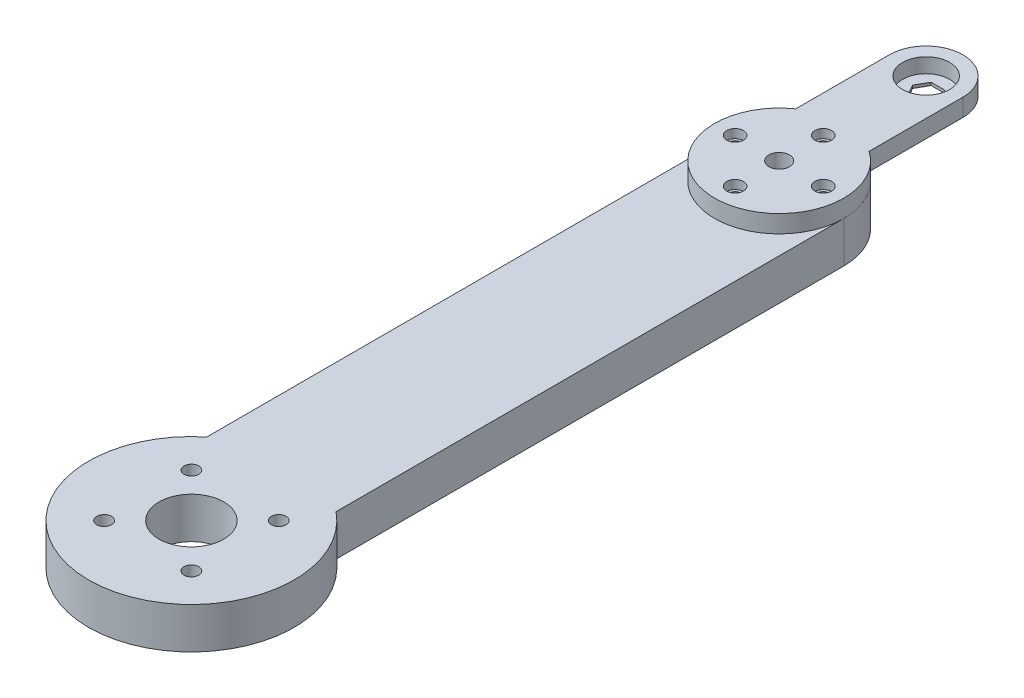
ISO-10303-21;
HEADER;
FILE_DESCRIPTION(('STEP AP214'),'2;1');
FILE_NAME('part.step','',(''),(''),'','','');
FILE_SCHEMA(('AUTOMOTIVE_DESIGN { 1 0 10303 214 1 1 1 1 }'));
ENDSEC;
DATA;
#1=APPLICATION_CONTEXT('core data for automotive mechanical design processes');
#2=APPLICATION_PROTOCOL_DEFINITION('international standard','automotive_design',2000,#1);
#3=PRODUCT_CONTEXT('',#1,'mechanical');
#4=PRODUCT('Part','Part','',(#3));
#5=PRODUCT_RELATED_PRODUCT_CATEGORY('part','',(#4));
#6=PRODUCT_DEFINITION_FORMATION('','',#4);
#7=PRODUCT_DEFINITION_CONTEXT('part definition',#1,'design');
#8=PRODUCT_DEFINITION('design','',#6,#7);
#9=PRODUCT_DEFINITION_SHAPE('','',#8);
#10=(LENGTH_UNIT() NAMED_UNIT(*) SI_UNIT(.MILLI.,.METRE.));
#11=(NAMED_UNIT(*) PLANE_ANGLE_UNIT() SI_UNIT($,.RADIAN.));
#12=(NAMED_UNIT(*) SI_UNIT($,.STERADIAN.) SOLID_ANGLE_UNIT());
#13=UNCERTAINTY_MEASURE_WITH_UNIT(LENGTH_MEASURE(1.E-05),#10,'distance_accuracy_value','');
#14=(GEOMETRIC_REPRESENTATION_CONTEXT(3) GLOBAL_UNCERTAINTY_ASSIGNED_CONTEXT((#13)) GLOBAL_UNIT_ASSIGNED_CONTEXT((#10,
#11,#12)) REPRESENTATION_CONTEXT('',''));
#15=CARTESIAN_POINT('',(0.,0.,0.));
#16=DIRECTION('',(0.,0.,1.));
#17=DIRECTION('',(1.,0.,0.));
#18=AXIS2_PLACEMENT_3D('',#15,#16,#17);
#19=CARTESIAN_POINT('',(-19.1317820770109,9.05467252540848,26.2321254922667));
#20=DIRECTION('',(0.,-1.,0.));
#21=DIRECTION('',(0.,0.,-1.));
#22=AXIS2_PLACEMENT_3D('',#19,#20,#21);
#23=CYLINDRICAL_SURFACE('',#22,22.);
#24=CARTESIAN_POINT('',(-19.1317820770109,3.05467252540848,26.2321254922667));
#25=DIRECTION('',(0.,1.,0.));
#26=DIRECTION('',(0.,0.,1.));
#27=AXIS2_PLACEMENT_3D('',#24,#25,#26);
#28=CIRCLE('',#27,22.);
#29=CARTESIAN_POINT('',(-31.6317820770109,3.05467252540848,8.12825850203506));
#30=VERTEX_POINT('',#29);
#31=CARTESIAN_POINT('',(-6.63178207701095,3.05467252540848,8.12825850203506));
#32=VERTEX_POINT('',#31);
#33=EDGE_CURVE('P0_E159',#30,#32,#28,.T.);
#34=ORIENTED_EDGE('',*,*,#33,.T.);
#35=DIRECTION('',(0.,-1.,0.));
#36=VECTOR('',#35,1.);
#37=CARTESIAN_POINT('',(-6.63178207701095,9.05467252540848,8.12825850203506));
#38=LINE('',#37,#36);
#39=CARTESIAN_POINT('',(-6.63178207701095,9.05467252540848,8.12825850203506));
#40=VERTEX_POINT('',#39);
#41=EDGE_CURVE('P0_E208',#40,#32,#38,.T.);
#42=ORIENTED_EDGE('',*,*,#41,.F.);
#43=CARTESIAN_POINT('',(-19.1317820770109,9.05467252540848,26.2321254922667));
#44=DIRECTION('',(0.,1.,0.));
#45=DIRECTION('',(0.,0.,1.));
#46=AXIS2_PLACEMENT_3D('',#43,#44,#45);
#47=CIRCLE('',#46,22.);
#48=CARTESIAN_POINT('',(-31.6317820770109,9.05467252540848,8.12825850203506));
#49=VERTEX_POINT('',#48);
#50=EDGE_CURVE('P0_E182',#49,#40,#47,.T.);
#51=ORIENTED_EDGE('',*,*,#50,.F.);
#52=DIRECTION('',(0.,-1.,0.));
#53=VECTOR('',#52,1.);
#54=CARTESIAN_POINT('',(-31.6317820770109,9.05467252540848,8.12825850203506));
#55=LINE('',#54,#53);
#56=EDGE_CURVE('P0_E192',#49,#30,#55,.T.);
#57=ORIENTED_EDGE('',*,*,#56,.T.);
#58=EDGE_LOOP('',(#34,#42,#51,#57));
#59=FACE_BOUND('',#58,.T.);
#60=ADVANCED_FACE('P0_F17',(#59),#23,.T.);
#61=CARTESIAN_POINT('',(-6.63178207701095,9.05467252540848,-23.7678745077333));
#62=DIRECTION('',(-1.,0.,0.));
#63=DIRECTION('',(0.,0.,1.));
#64=AXIS2_PLACEMENT_3D('',#61,#62,#63);
#65=PLANE('',#64);
#66=DIRECTION('',(0.,0.,-1.));
#67=VECTOR('',#66,1.);
#68=CARTESIAN_POINT('',(-6.63178207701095,3.05467252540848,-23.7678745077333));
#69=LINE('',#68,#67);
#70=CARTESIAN_POINT('',(-6.63178207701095,3.05467252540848,-23.7678745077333));
#71=VERTEX_POINT('',#70);
#72=EDGE_CURVE('P0_E195',#32,#71,#69,.T.);
#73=ORIENTED_EDGE('',*,*,#72,.T.);
#74=DIRECTION('',(0.,-1.,0.));
#75=VECTOR('',#74,1.);
#76=CARTESIAN_POINT('',(-6.63178207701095,9.05467252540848,-23.7678745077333));
#77=LINE('',#76,#75);
#78=CARTESIAN_POINT('',(-6.63178207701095,9.05467252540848,-23.7678745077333));
#79=VERTEX_POINT('',#78);
#80=EDGE_CURVE('P0_E205',#79,#71,#77,.T.);
#81=ORIENTED_EDGE('',*,*,#80,.F.);
#82=DIRECTION('',(0.,0.,-1.));
#83=VECTOR('',#82,1.);
#84=CARTESIAN_POINT('',(-6.63178207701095,9.05467252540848,-23.7678745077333));
#85=LINE('',#84,#83);
#86=EDGE_CURVE('P0_E185',#40,#79,#85,.T.);
#87=ORIENTED_EDGE('',*,*,#86,.F.);
#88=ORIENTED_EDGE('',*,*,#41,.T.);
#89=EDGE_LOOP('',(#73,#81,#87,#88));
#90=FACE_BOUND('',#89,.T.);
#91=ADVANCED_FACE('P0_F254',(#90),#65,.F.);
#92=CARTESIAN_POINT('',(-19.1317820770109,9.05467252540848,-23.7678745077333));
#93=DIRECTION('',(0.,-1.,0.));
#94=DIRECTION('',(0.,0.,-1.));
#95=AXIS2_PLACEMENT_3D('',#92,#93,#94);
#96=CYLINDRICAL_SURFACE('',#95,12.5);
#97=CARTESIAN_POINT('',(-19.1317820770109,3.05467252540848,-23.7678745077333));
#98=DIRECTION('',(0.,1.,0.));
#99=DIRECTION('',(0.,0.,1.));
#100=AXIS2_PLACEMENT_3D('',#97,#98,#99);
#101=CIRCLE('',#100,12.5);
#102=CARTESIAN_POINT('',(-31.6317820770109,3.05467252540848,-23.7678745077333));
#103=VERTEX_POINT('',#102);
#104=EDGE_CURVE('P0_E197',#71,#103,#101,.T.);
#105=ORIENTED_EDGE('',*,*,#104,.T.);
#106=DIRECTION('',(0.,-1.,0.));
#107=VECTOR('',#106,1.);
#108=CARTESIAN_POINT('',(-31.6317820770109,9.05467252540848,-23.7678745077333));
#109=LINE('',#108,#107);
#110=CARTESIAN_POINT('',(-31.6317820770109,9.05467252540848,-23.7678745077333));
#111=VERTEX_POINT('',#110);
#112=EDGE_CURVE('P0_E202',#111,#103,#109,.T.);
#113=ORIENTED_EDGE('',*,*,#112,.F.);
#114=CARTESIAN_POINT('',(-19.1317820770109,9.05467252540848,-23.7678745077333));
#115=DIRECTION('',(0.,1.,0.));
#116=DIRECTION('',(0.,0.,1.));
#117=AXIS2_PLACEMENT_3D('',#114,#115,#116);
#118=CIRCLE('',#117,12.5);
#119=EDGE_CURVE('P0_E188',#79,#111,#118,.T.);
#120=ORIENTED_EDGE('',*,*,#119,.F.);
#121=ORIENTED_EDGE('',*,*,#80,.T.);
#122=EDGE_LOOP('',(#105,#113,#120,#121));
#123=FACE_BOUND('',#122,.T.);
#124=ADVANCED_FACE('P0_F259',(#123),#96,.T.);
#125=CARTESIAN_POINT('',(-31.6317820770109,9.05467252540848,-23.7678745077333));
#126=DIRECTION('',(1.,0.,0.));
#127=DIRECTION('',(0.,0.,-1.));
#128=AXIS2_PLACEMENT_3D('',#125,#126,#127);
#129=PLANE('',#128);
#130=DIRECTION('',(0.,0.,1.));
#131=VECTOR('',#130,1.);
#132=CARTESIAN_POINT('',(-31.6317820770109,3.05467252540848,-23.7678745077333));
#133=LINE('',#132,#131);
#134=EDGE_CURVE('P0_E186',#103,#30,#133,.T.);
#135=ORIENTED_EDGE('',*,*,#134,.T.);
#136=ORIENTED_EDGE('',*,*,#56,.F.);
#137=DIRECTION('',(0.,0.,1.));
#138=VECTOR('',#137,1.);
#139=CARTESIAN_POINT('',(-31.6317820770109,9.05467252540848,-23.7678745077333));
#140=LINE('',#139,#138);
#141=EDGE_CURVE('P0_E190',#111,#49,#140,.T.);
#142=ORIENTED_EDGE('',*,*,#141,.F.);
#143=ORIENTED_EDGE('',*,*,#112,.T.);
#144=EDGE_LOOP('',(#135,#136,#142,#143));
#145=FACE_BOUND('',#144,.T.);
#146=ADVANCED_FACE('P0_F275',(#145),#129,.F.);
#147=CARTESIAN_POINT('',(-19.1317820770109,9.05467252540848,26.2321254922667));
#148=DIRECTION('',(0.,1.,0.));
#149=DIRECTION('',(0.,0.,1.));
#150=AXIS2_PLACEMENT_3D('',#147,#148,#149);
#151=PLANE('',#150);
#152=CARTESIAN_POINT('',(-19.1317820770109,9.05467252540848,-23.7678745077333));
#153=DIRECTION('',(0.,1.,0.));
#154=DIRECTION('',(0.,0.,1.));
#155=AXIS2_PLACEMENT_3D('',#152,#153,#154);
#156=CIRCLE('',#155,8.);
#157=CARTESIAN_POINT('',(-19.1317820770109,9.05467252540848,-15.7678745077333));
#158=VERTEX_POINT('',#157);
#159=EDGE_CURVE('P0_E125',#158,#158,#156,.T.);
#160=ORIENTED_EDGE('',*,*,#159,.F.);
#161=EDGE_LOOP('',(#160));
#162=FACE_BOUND('',#161,.T.);
#163=CARTESIAN_POINT('',(-19.1317820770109,9.05467252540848,26.2321254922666));
#164=DIRECTION('',(0.,1.,0.));
#165=DIRECTION('',(0.,0.,1.));
#166=AXIS2_PLACEMENT_3D('',#163,#164,#165);
#167=CIRCLE('',#166,3.5);
#168=CARTESIAN_POINT('',(-19.1317820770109,9.05467252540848,29.7321254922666));
#169=VERTEX_POINT('',#168);
#170=EDGE_CURVE('P0_E151',#169,#169,#167,.T.);
#171=ORIENTED_EDGE('',*,*,#170,.F.);
#172=EDGE_LOOP('',(#171));
#173=FACE_BOUND('',#172,.T.);
#174=CARTESIAN_POINT('',(-19.1317820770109,9.05467252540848,11.2321254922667));
#175=DIRECTION('',(0.,1.,0.));
#176=DIRECTION('',(0.,0.,1.));
#177=AXIS2_PLACEMENT_3D('',#174,#175,#176);
#178=CIRCLE('',#177,2.85);
#179=CARTESIAN_POINT('',(-19.1317820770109,9.05467252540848,14.0821254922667));
#180=VERTEX_POINT('',#179);
#181=EDGE_CURVE('P0_E160',#180,#180,#178,.T.);
#182=ORIENTED_EDGE('',*,*,#181,.F.);
#183=EDGE_LOOP('',(#182));
#184=FACE_BOUND('',#183,.T.);
#185=CARTESIAN_POINT('',(-4.13178207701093,9.05467252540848,26.2321254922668));
#186=DIRECTION('',(0.,1.,0.));
#187=DIRECTION('',(0.,0.,1.));
#188=AXIS2_PLACEMENT_3D('',#185,#186,#187);
#189=CIRCLE('',#188,2.85);
#190=CARTESIAN_POINT('',(-4.13178207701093,9.05467252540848,29.0821254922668));
#191=VERTEX_POINT('',#190);
#192=EDGE_CURVE('P0_E166',#191,#191,#189,.T.);
#193=ORIENTED_EDGE('',*,*,#192,.F.);
#194=EDGE_LOOP('',(#193));
#195=FACE_BOUND('',#194,.T.);
#196=CARTESIAN_POINT('',(-19.131782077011,9.05467252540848,41.2321254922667));
#197=DIRECTION('',(0.,1.,0.));
#198=DIRECTION('',(0.,0.,1.));
#199=AXIS2_PLACEMENT_3D('',#196,#197,#198);
#200=CIRCLE('',#199,2.85);
#201=CARTESIAN_POINT('',(-19.131782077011,9.05467252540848,44.0821254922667));
#202=VERTEX_POINT('',#201);
#203=EDGE_CURVE('P0_E172',#202,#202,#200,.T.);
#204=ORIENTED_EDGE('',*,*,#203,.F.);
#205=EDGE_LOOP('',(#204));
#206=FACE_BOUND('',#205,.T.);
#207=CARTESIAN_POINT('',(-34.1317820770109,9.05467252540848,26.2321254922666));
#208=DIRECTION('',(0.,1.,0.));
#209=DIRECTION('',(0.,0.,1.));
#210=AXIS2_PLACEMENT_3D('',#207,#208,#209);
#211=CIRCLE('',#210,2.85);
#212=CARTESIAN_POINT('',(-34.1317820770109,9.05467252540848,29.0821254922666));
#213=VERTEX_POINT('',#212);
#214=EDGE_CURVE('P0_E178',#213,#213,#211,.T.);
#215=ORIENTED_EDGE('',*,*,#214,.F.);
#216=EDGE_LOOP('',(#215));
#217=FACE_BOUND('',#216,.T.);
#218=ORIENTED_EDGE('',*,*,#50,.T.);
#219=ORIENTED_EDGE('',*,*,#86,.T.);
#220=ORIENTED_EDGE('',*,*,#119,.T.);
#221=ORIENTED_EDGE('',*,*,#141,.T.);
#222=EDGE_LOOP('',(#218,#219,#220,#221));
#223=FACE_BOUND('',#222,.T.);
#224=ADVANCED_FACE('P0_F271',(#162,#173,#184,#195,#206,#217,#223),#151,.T.);
#225=CARTESIAN_POINT('',(-19.1317820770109,3.05467252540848,26.2321254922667));
#226=DIRECTION('',(0.,1.,0.));
#227=DIRECTION('',(0.,0.,1.));
#228=AXIS2_PLACEMENT_3D('',#225,#226,#227);
#229=PLANE('',#228);
#230=DIRECTION('',(-0.5,0.,0.866025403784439));
#231=VECTOR('',#230,1.);
#232=CARTESIAN_POINT('',(-14.5129799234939,3.05467252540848,-23.7678745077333));
#233=LINE('',#232,#231);
#234=CARTESIAN_POINT('',(-14.5129799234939,3.05467252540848,-23.7678745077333));
#235=VERTEX_POINT('',#234);
#236=CARTESIAN_POINT('',(-16.8223810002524,3.05467252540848,-19.7678745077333));
#237=VERTEX_POINT('',#236);
#238=EDGE_CURVE('P0_E104',#235,#237,#233,.T.);
#239=ORIENTED_EDGE('',*,*,#238,.F.);
#240=DIRECTION('',(0.499999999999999,0.,0.866025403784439));
#241=VECTOR('',#240,1.);
#242=CARTESIAN_POINT('',(-16.8223810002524,3.05467252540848,-27.7678745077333));
#243=LINE('',#242,#241);
#244=CARTESIAN_POINT('',(-16.8223810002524,3.05467252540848,-27.7678745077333));
#245=VERTEX_POINT('',#244);
#246=EDGE_CURVE('P0_E31',#245,#235,#243,.T.);
#247=ORIENTED_EDGE('',*,*,#246,.F.);
#248=DIRECTION('',(1.,0.,0.));
#249=VECTOR('',#248,1.);
#250=CARTESIAN_POINT('',(-21.4411831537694,3.05467252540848,-27.7678745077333));
#251=LINE('',#250,#249);
#252=CARTESIAN_POINT('',(-21.4411831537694,3.05467252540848,-27.7678745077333));
#253=VERTEX_POINT('',#252);
#254=EDGE_CURVE('P0_E120',#253,#245,#251,.T.);
#255=ORIENTED_EDGE('',*,*,#254,.F.);
#256=DIRECTION('',(0.5,0.,-0.866025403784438));
#257=VECTOR('',#256,1.);
#258=CARTESIAN_POINT('',(-23.7505842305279,3.05467252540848,-23.7678745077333));
#259=LINE('',#258,#257);
#260=CARTESIAN_POINT('',(-23.7505842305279,3.05467252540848,-23.7678745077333));
#261=VERTEX_POINT('',#260);
#262=EDGE_CURVE('P0_E114',#261,#253,#259,.T.);
#263=ORIENTED_EDGE('',*,*,#262,.F.);
#264=DIRECTION('',(-0.499999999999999,0.,-0.866025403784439));
#265=VECTOR('',#264,1.);
#266=CARTESIAN_POINT('',(-21.4411831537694,3.05467252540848,-19.7678745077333));
#267=LINE('',#266,#265);
#268=CARTESIAN_POINT('',(-21.4411831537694,3.05467252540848,-19.7678745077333));
#269=VERTEX_POINT('',#268);
#270=EDGE_CURVE('P0_E112',#269,#261,#267,.T.);
#271=ORIENTED_EDGE('',*,*,#270,.F.);
#272=DIRECTION('',(-1.,0.,0.));
#273=VECTOR('',#272,1.);
#274=CARTESIAN_POINT('',(-16.8223810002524,3.05467252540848,-19.7678745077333));
#275=LINE('',#274,#273);
#276=EDGE_CURVE('P0_E95',#237,#269,#275,.T.);
#277=ORIENTED_EDGE('',*,*,#276,.F.);
#278=EDGE_LOOP('',(#239,#247,#255,#263,#271,#277));
#279=FACE_BOUND('',#278,.T.);
#280=CARTESIAN_POINT('',(-19.1317820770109,3.05467252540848,11.2321254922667));
#281=DIRECTION('',(0.,1.,0.));
#282=DIRECTION('',(0.,0.,1.));
#283=AXIS2_PLACEMENT_3D('',#280,#281,#282);
#284=CIRCLE('',#283,2.);
#285=CARTESIAN_POINT('',(-19.1317820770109,3.05467252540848,13.2321254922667));
#286=VERTEX_POINT('',#285);
#287=EDGE_CURVE('P0_E138',#286,#286,#284,.T.);
#288=ORIENTED_EDGE('',*,*,#287,.T.);
#289=EDGE_LOOP('',(#288));
#290=FACE_BOUND('',#289,.T.);
#291=CARTESIAN_POINT('',(-34.1317820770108,3.05467252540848,26.2321254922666));
#292=DIRECTION('',(0.,1.,0.));
#293=DIRECTION('',(0.,0.,1.));
#294=AXIS2_PLACEMENT_3D('',#291,#292,#293);
#295=CIRCLE('',#294,2.00000000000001);
#296=CARTESIAN_POINT('',(-34.1317820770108,3.05467252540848,28.2321254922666));
#297=VERTEX_POINT('',#296);
#298=EDGE_CURVE('P0_E135',#297,#297,#295,.T.);
#299=ORIENTED_EDGE('',*,*,#298,.T.);
#300=EDGE_LOOP('',(#299));
#301=FACE_BOUND('',#300,.T.);
#302=CARTESIAN_POINT('',(-19.1317820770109,3.05467252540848,41.2321254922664));
#303=DIRECTION('',(0.,1.,0.));
#304=DIRECTION('',(0.,0.,1.));
#305=AXIS2_PLACEMENT_3D('',#302,#303,#304);
#306=CIRCLE('',#305,2.);
#307=CARTESIAN_POINT('',(-19.1317820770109,3.05467252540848,43.2321254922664));
#308=VERTEX_POINT('',#307);
#309=EDGE_CURVE('P0_E143',#308,#308,#306,.T.);
#310=ORIENTED_EDGE('',*,*,#309,.T.);
#311=EDGE_LOOP('',(#310));
#312=FACE_BOUND('',#311,.T.);
#313=CARTESIAN_POINT('',(-4.1317820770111,3.05467252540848,26.2321254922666));
#314=DIRECTION('',(0.,1.,0.));
#315=DIRECTION('',(0.,0.,1.));
#316=AXIS2_PLACEMENT_3D('',#313,#314,#315);
#317=CIRCLE('',#316,2.);
#318=CARTESIAN_POINT('',(-4.1317820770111,3.05467252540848,28.2321254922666));
#319=VERTEX_POINT('',#318);
#320=EDGE_CURVE('P0_E146',#319,#319,#317,.T.);
#321=ORIENTED_EDGE('',*,*,#320,.T.);
#322=EDGE_LOOP('',(#321));
#323=FACE_BOUND('',#322,.T.);
#324=CARTESIAN_POINT('',(-19.1317820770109,3.05467252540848,26.2321254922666));
#325=DIRECTION('',(0.,1.,0.));
#326=DIRECTION('',(0.,0.,1.));
#327=AXIS2_PLACEMENT_3D('',#324,#325,#326);
#328=CIRCLE('',#327,3.5);
#329=CARTESIAN_POINT('',(-19.1317820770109,3.05467252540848,29.7321254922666));
#330=VERTEX_POINT('',#329);
#331=EDGE_CURVE('P0_E142',#330,#330,#328,.T.);
#332=ORIENTED_EDGE('',*,*,#331,.T.);
#333=EDGE_LOOP('',(#332));
#334=FACE_BOUND('',#333,.T.);
#335=ORIENTED_EDGE('',*,*,#33,.F.);
#336=ORIENTED_EDGE('',*,*,#134,.F.);
#337=ORIENTED_EDGE('',*,*,#104,.F.);
#338=ORIENTED_EDGE('',*,*,#72,.F.);
#339=EDGE_LOOP('',(#335,#336,#337,#338));
#340=FACE_BOUND('',#339,.T.);
#341=ADVANCED_FACE('P0_F108',(#279,#290,#301,#312,#323,#334,#340),#229,.F.);
#342=CARTESIAN_POINT('',(-34.1317820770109,6.05467252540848,26.2321254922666));
#343=DIRECTION('',(0.,1.,0.));
#344=DIRECTION('',(0.,0.,1.));
#345=AXIS2_PLACEMENT_3D('',#342,#343,#344);
#346=CYLINDRICAL_SURFACE('',#345,2.85);
#347=CARTESIAN_POINT('',(-34.1317820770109,6.05467252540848,26.2321254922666));
#348=DIRECTION('',(0.,1.,0.));
#349=DIRECTION('',(0.,0.,1.));
#350=AXIS2_PLACEMENT_3D('',#347,#348,#349);
#351=CIRCLE('',#350,2.85);
#352=CARTESIAN_POINT('',(-34.1317820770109,6.05467252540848,29.0821254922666));
#353=VERTEX_POINT('',#352);
#354=EDGE_CURVE('P0_E175',#353,#353,#351,.T.);
#355=ORIENTED_EDGE('',*,*,#354,.F.);
#356=EDGE_LOOP('',(#355));
#357=FACE_BOUND('',#356,.T.);
#358=ORIENTED_EDGE('',*,*,#214,.T.);
#359=EDGE_LOOP('',(#358));
#360=FACE_BOUND('',#359,.T.);
#361=ADVANCED_FACE('P0_F286',(#357,#360),#346,.F.);
#362=CARTESIAN_POINT('',(-34.1317820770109,6.05467252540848,26.2321254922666));
#363=DIRECTION('',(0.,1.,0.));
#364=DIRECTION('',(0.,0.,1.));
#365=AXIS2_PLACEMENT_3D('',#362,#363,#364);
#366=PLANE('',#365);
#367=CARTESIAN_POINT('',(-34.1317820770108,6.05467252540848,26.2321254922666));
#368=DIRECTION('',(0.,1.,0.));
#369=DIRECTION('',(0.,0.,1.));
#370=AXIS2_PLACEMENT_3D('',#367,#368,#369);
#371=CIRCLE('',#370,2.00000000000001);
#372=CARTESIAN_POINT('',(-34.1317820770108,6.05467252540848,28.2321254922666));
#373=VERTEX_POINT('',#372);
#374=EDGE_CURVE('P0_E181',#373,#373,#371,.T.);
#375=ORIENTED_EDGE('',*,*,#374,.F.);
#376=EDGE_LOOP('',(#375));
#377=FACE_BOUND('',#376,.T.);
#378=ORIENTED_EDGE('',*,*,#354,.T.);
#379=EDGE_LOOP('',(#378));
#380=FACE_BOUND('',#379,.T.);
#381=ADVANCED_FACE('P0_F292',(#377,#380),#366,.T.);
#382=CARTESIAN_POINT('',(-19.131782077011,6.05467252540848,41.2321254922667));
#383=DIRECTION('',(0.,1.,0.));
#384=DIRECTION('',(0.,0.,1.));
#385=AXIS2_PLACEMENT_3D('',#382,#383,#384);
#386=CYLINDRICAL_SURFACE('',#385,2.85);
#387=CARTESIAN_POINT('',(-19.131782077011,6.05467252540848,41.2321254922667));
#388=DIRECTION('',(0.,1.,0.));
#389=DIRECTION('',(0.,0.,1.));
#390=AXIS2_PLACEMENT_3D('',#387,#388,#389);
#391=CIRCLE('',#390,2.85);
#392=CARTESIAN_POINT('',(-19.131782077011,6.05467252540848,44.0821254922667));
#393=VERTEX_POINT('',#392);
#394=EDGE_CURVE('P0_E169',#393,#393,#391,.T.);
#395=ORIENTED_EDGE('',*,*,#394,.F.);
#396=EDGE_LOOP('',(#395));
#397=FACE_BOUND('',#396,.T.);
#398=ORIENTED_EDGE('',*,*,#203,.T.);
#399=EDGE_LOOP('',(#398));
#400=FACE_BOUND('',#399,.T.);
#401=ADVANCED_FACE('P0_F296',(#397,#400),#386,.F.);
#402=CARTESIAN_POINT('',(-19.131782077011,6.05467252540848,41.2321254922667));
#403=DIRECTION('',(0.,1.,0.));
#404=DIRECTION('',(0.,0.,1.));
#405=AXIS2_PLACEMENT_3D('',#402,#403,#404);
#406=PLANE('',#405);
#407=CARTESIAN_POINT('',(-19.1317820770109,6.05467252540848,41.2321254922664));
#408=DIRECTION('',(0.,1.,0.));
#409=DIRECTION('',(0.,0.,1.));
#410=AXIS2_PLACEMENT_3D('',#407,#408,#409);
#411=CIRCLE('',#410,2.);
#412=CARTESIAN_POINT('',(-19.1317820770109,6.05467252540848,43.2321254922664));
#413=VERTEX_POINT('',#412);
#414=EDGE_CURVE('P0_E217',#413,#413,#411,.T.);
#415=ORIENTED_EDGE('',*,*,#414,.F.);
#416=EDGE_LOOP('',(#415));
#417=FACE_BOUND('',#416,.T.);
#418=ORIENTED_EDGE('',*,*,#394,.T.);
#419=EDGE_LOOP('',(#418));
#420=FACE_BOUND('',#419,.T.);
#421=ADVANCED_FACE('P0_F300',(#417,#420),#406,.T.);
#422=CARTESIAN_POINT('',(-4.13178207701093,6.05467252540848,26.2321254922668));
#423=DIRECTION('',(0.,1.,0.));
#424=DIRECTION('',(0.,0.,1.));
#425=AXIS2_PLACEMENT_3D('',#422,#423,#424);
#426=CYLINDRICAL_SURFACE('',#425,2.85);
#427=CARTESIAN_POINT('',(-4.13178207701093,6.05467252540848,26.2321254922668));
#428=DIRECTION('',(0.,1.,0.));
#429=DIRECTION('',(0.,0.,1.));
#430=AXIS2_PLACEMENT_3D('',#427,#428,#429);
#431=CIRCLE('',#430,2.85);
#432=CARTESIAN_POINT('',(-4.13178207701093,6.05467252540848,29.0821254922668));
#433=VERTEX_POINT('',#432);
#434=EDGE_CURVE('P0_E163',#433,#433,#431,.T.);
#435=ORIENTED_EDGE('',*,*,#434,.F.);
#436=EDGE_LOOP('',(#435));
#437=FACE_BOUND('',#436,.T.);
#438=ORIENTED_EDGE('',*,*,#192,.T.);
#439=EDGE_LOOP('',(#438));
#440=FACE_BOUND('',#439,.T.);
#441=ADVANCED_FACE('P0_F304',(#437,#440),#426,.F.);
#442=CARTESIAN_POINT('',(-4.13178207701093,6.05467252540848,26.2321254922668));
#443=DIRECTION('',(0.,1.,0.));
#444=DIRECTION('',(0.,0.,1.));
#445=AXIS2_PLACEMENT_3D('',#442,#443,#444);
#446=PLANE('',#445);
#447=CARTESIAN_POINT('',(-4.1317820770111,6.05467252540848,26.2321254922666));
#448=DIRECTION('',(0.,1.,0.));
#449=DIRECTION('',(0.,0.,1.));
#450=AXIS2_PLACEMENT_3D('',#447,#448,#449);
#451=CIRCLE('',#450,2.);
#452=CARTESIAN_POINT('',(-4.1317820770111,6.05467252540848,28.2321254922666));
#453=VERTEX_POINT('',#452);
#454=EDGE_CURVE('P0_E214',#453,#453,#451,.T.);
#455=ORIENTED_EDGE('',*,*,#454,.F.);
#456=EDGE_LOOP('',(#455));
#457=FACE_BOUND('',#456,.T.);
#458=ORIENTED_EDGE('',*,*,#434,.T.);
#459=EDGE_LOOP('',(#458));
#460=FACE_BOUND('',#459,.T.);
#461=ADVANCED_FACE('P0_F308',(#457,#460),#446,.T.);
#462=CARTESIAN_POINT('',(-19.1317820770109,6.05467252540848,11.2321254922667));
#463=DIRECTION('',(0.,1.,0.));
#464=DIRECTION('',(0.,0.,1.));
#465=AXIS2_PLACEMENT_3D('',#462,#463,#464);
#466=CYLINDRICAL_SURFACE('',#465,2.85);
#467=CARTESIAN_POINT('',(-19.1317820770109,6.05467252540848,11.2321254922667));
#468=DIRECTION('',(0.,1.,0.));
#469=DIRECTION('',(0.,0.,1.));
#470=AXIS2_PLACEMENT_3D('',#467,#468,#469);
#471=CIRCLE('',#470,2.85);
#472=CARTESIAN_POINT('',(-19.1317820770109,6.05467252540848,14.0821254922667));
#473=VERTEX_POINT('',#472);
#474=EDGE_CURVE('P0_E156',#473,#473,#471,.T.);
#475=ORIENTED_EDGE('',*,*,#474,.F.);
#476=EDGE_LOOP('',(#475));
#477=FACE_BOUND('',#476,.T.);
#478=ORIENTED_EDGE('',*,*,#181,.T.);
#479=EDGE_LOOP('',(#478));
#480=FACE_BOUND('',#479,.T.);
#481=ADVANCED_FACE('P0_F312',(#477,#480),#466,.F.);
#482=CARTESIAN_POINT('',(-19.1317820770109,6.05467252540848,11.2321254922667));
#483=DIRECTION('',(0.,1.,0.));
#484=DIRECTION('',(0.,0.,1.));
#485=AXIS2_PLACEMENT_3D('',#482,#483,#484);
#486=PLANE('',#485);
#487=CARTESIAN_POINT('',(-19.1317820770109,6.05467252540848,11.2321254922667));
#488=DIRECTION('',(0.,1.,0.));
#489=DIRECTION('',(0.,0.,1.));
#490=AXIS2_PLACEMENT_3D('',#487,#488,#489);
#491=CIRCLE('',#490,2.);
#492=CARTESIAN_POINT('',(-19.1317820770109,6.05467252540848,13.2321254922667));
#493=VERTEX_POINT('',#492);
#494=EDGE_CURVE('P0_E141',#493,#493,#491,.T.);
#495=ORIENTED_EDGE('',*,*,#494,.F.);
#496=EDGE_LOOP('',(#495));
#497=FACE_BOUND('',#496,.T.);
#498=ORIENTED_EDGE('',*,*,#474,.T.);
#499=EDGE_LOOP('',(#498));
#500=FACE_BOUND('',#499,.T.);
#501=ADVANCED_FACE('P0_F316',(#497,#500),#486,.T.);
#502=CARTESIAN_POINT('',(-19.1317820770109,3.05467252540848,11.2321254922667));
#503=DIRECTION('',(0.,1.,0.));
#504=DIRECTION('',(0.,0.,1.));
#505=AXIS2_PLACEMENT_3D('',#502,#503,#504);
#506=CYLINDRICAL_SURFACE('',#505,2.);
#507=ORIENTED_EDGE('',*,*,#494,.T.);
#508=EDGE_LOOP('',(#507));
#509=FACE_BOUND('',#508,.T.);
#510=ORIENTED_EDGE('',*,*,#287,.F.);
#511=EDGE_LOOP('',(#510));
#512=FACE_BOUND('',#511,.T.);
#513=ADVANCED_FACE('P0_F320',(#509,#512),#506,.F.);
#514=CARTESIAN_POINT('',(-4.1317820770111,3.05467252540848,26.2321254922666));
#515=DIRECTION('',(0.,1.,0.));
#516=DIRECTION('',(0.,0.,1.));
#517=AXIS2_PLACEMENT_3D('',#514,#515,#516);
#518=CYLINDRICAL_SURFACE('',#517,2.);
#519=ORIENTED_EDGE('',*,*,#454,.T.);
#520=EDGE_LOOP('',(#519));
#521=FACE_BOUND('',#520,.T.);
#522=ORIENTED_EDGE('',*,*,#320,.F.);
#523=EDGE_LOOP('',(#522));
#524=FACE_BOUND('',#523,.T.);
#525=ADVANCED_FACE('P0_F322',(#521,#524),#518,.F.);
#526=CARTESIAN_POINT('',(-19.1317820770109,3.05467252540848,41.2321254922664));
#527=DIRECTION('',(0.,1.,0.));
#528=DIRECTION('',(0.,0.,1.));
#529=AXIS2_PLACEMENT_3D('',#526,#527,#528);
#530=CYLINDRICAL_SURFACE('',#529,2.);
#531=ORIENTED_EDGE('',*,*,#414,.T.);
#532=EDGE_LOOP('',(#531));
#533=FACE_BOUND('',#532,.T.);
#534=ORIENTED_EDGE('',*,*,#309,.F.);
#535=EDGE_LOOP('',(#534));
#536=FACE_BOUND('',#535,.T.);
#537=ADVANCED_FACE('P0_F325',(#533,#536),#530,.F.);
#538=CARTESIAN_POINT('',(-34.1317820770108,3.05467252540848,26.2321254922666));
#539=DIRECTION('',(0.,1.,0.));
#540=DIRECTION('',(0.,0.,1.));
#541=AXIS2_PLACEMENT_3D('',#538,#539,#540);
#542=CYLINDRICAL_SURFACE('',#541,2.00000000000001);
#543=ORIENTED_EDGE('',*,*,#374,.T.);
#544=EDGE_LOOP('',(#543));
#545=FACE_BOUND('',#544,.T.);
#546=ORIENTED_EDGE('',*,*,#298,.F.);
#547=EDGE_LOOP('',(#546));
#548=FACE_BOUND('',#547,.T.);
#549=ADVANCED_FACE('P0_F331',(#545,#548),#542,.F.);
#550=CARTESIAN_POINT('',(-19.1317820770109,3.05467252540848,26.2321254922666));
#551=DIRECTION('',(0.,1.,0.));
#552=DIRECTION('',(0.,0.,1.));
#553=AXIS2_PLACEMENT_3D('',#550,#551,#552);
#554=CYLINDRICAL_SURFACE('',#553,3.5);
#555=ORIENTED_EDGE('',*,*,#331,.F.);
#556=EDGE_LOOP('',(#555));
#557=FACE_BOUND('',#556,.T.);
#558=ORIENTED_EDGE('',*,*,#170,.T.);
#559=EDGE_LOOP('',(#558));
#560=FACE_BOUND('',#559,.T.);
#561=ADVANCED_FACE('P0_F327',(#557,#560),#554,.F.);
#562=CARTESIAN_POINT('',(-19.1317820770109,4.05467252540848,-23.7678745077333));
#563=DIRECTION('',(0.,1.,0.));
#564=DIRECTION('',(0.,0.,1.));
#565=AXIS2_PLACEMENT_3D('',#562,#563,#564);
#566=CYLINDRICAL_SURFACE('',#565,8.);
#567=CARTESIAN_POINT('',(-19.1317820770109,4.05467252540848,-23.7678745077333));
#568=DIRECTION('',(0.,1.,0.));
#569=DIRECTION('',(0.,0.,1.));
#570=AXIS2_PLACEMENT_3D('',#567,#568,#569);
#571=CIRCLE('',#570,8.);
#572=CARTESIAN_POINT('',(-19.1317820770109,4.05467252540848,-15.7678745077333));
#573=VERTEX_POINT('',#572);
#574=EDGE_CURVE('P0_E132',#573,#573,#571,.T.);
#575=ORIENTED_EDGE('',*,*,#574,.F.);
#576=EDGE_LOOP('',(#575));
#577=FACE_BOUND('',#576,.T.);
#578=ORIENTED_EDGE('',*,*,#159,.T.);
#579=EDGE_LOOP('',(#578));
#580=FACE_BOUND('',#579,.T.);
#581=ADVANCED_FACE('P0_F330',(#577,#580),#566,.F.);
#582=CARTESIAN_POINT('',(-19.1317820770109,4.05467252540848,-23.7678745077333));
#583=DIRECTION('',(0.,1.,0.));
#584=DIRECTION('',(0.,0.,1.));
#585=AXIS2_PLACEMENT_3D('',#582,#583,#584);
#586=PLANE('',#585);
#587=DIRECTION('',(-0.499999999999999,0.,-0.866025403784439));
#588=VECTOR('',#587,1.);
#589=CARTESIAN_POINT('',(-15.6676804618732,4.05467252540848,-25.7678745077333));
#590=LINE('',#589,#588);
#591=CARTESIAN_POINT('',(-14.5129799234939,4.05467252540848,-23.7678745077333));
#592=VERTEX_POINT('',#591);
#593=CARTESIAN_POINT('',(-16.8223810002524,4.05467252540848,-27.7678745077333));
#594=VERTEX_POINT('',#593);
#595=EDGE_CURVE('P0_E11',#592,#594,#590,.T.);
#596=ORIENTED_EDGE('',*,*,#595,.F.);
#597=DIRECTION('',(0.5,0.,-0.866025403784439));
#598=VECTOR('',#597,1.);
#599=CARTESIAN_POINT('',(-15.6676804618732,4.05467252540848,-21.7678745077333));
#600=LINE('',#599,#598);
#601=CARTESIAN_POINT('',(-16.8223810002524,4.05467252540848,-19.7678745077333));
#602=VERTEX_POINT('',#601);
#603=EDGE_CURVE('P0_E211',#602,#592,#600,.T.);
#604=ORIENTED_EDGE('',*,*,#603,.F.);
#605=DIRECTION('',(1.,0.,0.));
#606=VECTOR('',#605,1.);
#607=CARTESIAN_POINT('',(-19.1317820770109,4.05467252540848,-19.7678745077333));
#608=LINE('',#607,#606);
#609=CARTESIAN_POINT('',(-21.4411831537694,4.05467252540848,-19.7678745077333));
#610=VERTEX_POINT('',#609);
#611=EDGE_CURVE('P0_E98',#610,#602,#608,.T.);
#612=ORIENTED_EDGE('',*,*,#611,.F.);
#613=DIRECTION('',(0.499999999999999,0.,0.866025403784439));
#614=VECTOR('',#613,1.);
#615=CARTESIAN_POINT('',(-22.5958836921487,4.05467252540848,-21.7678745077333));
#616=LINE('',#615,#614);
#617=CARTESIAN_POINT('',(-23.7505842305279,4.05467252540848,-23.7678745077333));
#618=VERTEX_POINT('',#617);
#619=EDGE_CURVE('P0_E224',#618,#610,#616,.T.);
#620=ORIENTED_EDGE('',*,*,#619,.F.);
#621=DIRECTION('',(-0.500000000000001,0.,0.866025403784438));
#622=VECTOR('',#621,1.);
#623=CARTESIAN_POINT('',(-22.5958836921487,4.05467252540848,-25.7678745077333));
#624=LINE('',#623,#622);
#625=CARTESIAN_POINT('',(-21.4411831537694,4.05467252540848,-27.7678745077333));
#626=VERTEX_POINT('',#625);
#627=EDGE_CURVE('P0_E226',#626,#618,#624,.T.);
#628=ORIENTED_EDGE('',*,*,#627,.F.);
#629=DIRECTION('',(-1.,0.,0.));
#630=VECTOR('',#629,1.);
#631=CARTESIAN_POINT('',(-19.1317820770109,4.05467252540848,-27.7678745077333));
#632=LINE('',#631,#630);
#633=EDGE_CURVE('P0_E24',#594,#626,#632,.T.);
#634=ORIENTED_EDGE('',*,*,#633,.F.);
#635=EDGE_LOOP('',(#596,#604,#612,#620,#628,#634));
#636=FACE_BOUND('',#635,.T.);
#637=ORIENTED_EDGE('',*,*,#574,.T.);
#638=EDGE_LOOP('',(#637));
#639=FACE_BOUND('',#638,.T.);
#640=ADVANCED_FACE('P0_F240',(#636,#639),#586,.T.);
#641=CARTESIAN_POINT('',(-16.8223810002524,6.05467252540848,-27.7678745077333));
#642=DIRECTION('',(0.866025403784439,0.,-0.499999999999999));
#643=DIRECTION('',(-0.499999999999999,0.,-0.866025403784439));
#644=AXIS2_PLACEMENT_3D('',#641,#642,#643);
#645=PLANE('',#644);
#646=ORIENTED_EDGE('',*,*,#595,.T.);
#647=DIRECTION('',(0.,-1.,0.));
#648=VECTOR('',#647,1.);
#649=CARTESIAN_POINT('',(-16.8223810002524,6.05467252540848,-27.7678745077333));
#650=LINE('',#649,#648);
#651=EDGE_CURVE('P0_E123',#594,#245,#650,.T.);
#652=ORIENTED_EDGE('',*,*,#651,.T.);
#653=ORIENTED_EDGE('',*,*,#246,.T.);
#654=DIRECTION('',(0.,-1.,0.));
#655=VECTOR('',#654,1.);
#656=CARTESIAN_POINT('',(-14.5129799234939,6.05467252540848,-23.7678745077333));
#657=LINE('',#656,#655);
#658=EDGE_CURVE('P0_E101',#592,#235,#657,.T.);
#659=ORIENTED_EDGE('',*,*,#658,.F.);
#660=EDGE_LOOP('',(#646,#652,#653,#659));
#661=FACE_BOUND('',#660,.T.);
#662=ADVANCED_FACE('P0_F347',(#661),#645,.F.);
#663=CARTESIAN_POINT('',(-21.4411831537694,6.05467252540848,-27.7678745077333));
#664=DIRECTION('',(0.,0.,-1.));
#665=DIRECTION('',(-1.,0.,0.));
#666=AXIS2_PLACEMENT_3D('',#663,#664,#665);
#667=PLANE('',#666);
#668=ORIENTED_EDGE('',*,*,#633,.T.);
#669=DIRECTION('',(0.,-1.,0.));
#670=VECTOR('',#669,1.);
#671=CARTESIAN_POINT('',(-21.4411831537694,6.05467252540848,-27.7678745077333));
#672=LINE('',#671,#670);
#673=EDGE_CURVE('P0_E126',#626,#253,#672,.T.);
#674=ORIENTED_EDGE('',*,*,#673,.T.);
#675=ORIENTED_EDGE('',*,*,#254,.T.);
#676=ORIENTED_EDGE('',*,*,#651,.F.);
#677=EDGE_LOOP('',(#668,#674,#675,#676));
#678=FACE_BOUND('',#677,.T.);
#679=ADVANCED_FACE('P0_F231',(#678),#667,.F.);
#680=CARTESIAN_POINT('',(-23.7505842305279,6.05467252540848,-23.7678745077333));
#681=DIRECTION('',(-0.866025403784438,0.,-0.500000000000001));
#682=DIRECTION('',(-0.500000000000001,0.,0.866025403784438));
#683=AXIS2_PLACEMENT_3D('',#680,#681,#682);
#684=PLANE('',#683);
#685=ORIENTED_EDGE('',*,*,#627,.T.);
#686=DIRECTION('',(0.,-1.,0.));
#687=VECTOR('',#686,1.);
#688=CARTESIAN_POINT('',(-23.7505842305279,6.05467252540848,-23.7678745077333));
#689=LINE('',#688,#687);
#690=EDGE_CURVE('P0_E128',#618,#261,#689,.T.);
#691=ORIENTED_EDGE('',*,*,#690,.T.);
#692=ORIENTED_EDGE('',*,*,#262,.T.);
#693=ORIENTED_EDGE('',*,*,#673,.F.);
#694=EDGE_LOOP('',(#685,#691,#692,#693));
#695=FACE_BOUND('',#694,.T.);
#696=ADVANCED_FACE('P0_F236',(#695),#684,.F.);
#697=CARTESIAN_POINT('',(-21.4411831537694,6.05467252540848,-19.7678745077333));
#698=DIRECTION('',(-0.866025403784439,0.,0.499999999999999));
#699=DIRECTION('',(0.499999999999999,0.,0.866025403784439));
#700=AXIS2_PLACEMENT_3D('',#697,#698,#699);
#701=PLANE('',#700);
#702=ORIENTED_EDGE('',*,*,#619,.T.);
#703=DIRECTION('',(0.,-1.,0.));
#704=VECTOR('',#703,1.);
#705=CARTESIAN_POINT('',(-21.4411831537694,6.05467252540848,-19.7678745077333));
#706=LINE('',#705,#704);
#707=EDGE_CURVE('P0_E100',#610,#269,#706,.T.);
#708=ORIENTED_EDGE('',*,*,#707,.T.);
#709=ORIENTED_EDGE('',*,*,#270,.T.);
#710=ORIENTED_EDGE('',*,*,#690,.F.);
#711=EDGE_LOOP('',(#702,#708,#709,#710));
#712=FACE_BOUND('',#711,.T.);
#713=ADVANCED_FACE('P0_F243',(#712),#701,.F.);
#714=CARTESIAN_POINT('',(-16.8223810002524,6.05467252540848,-19.7678745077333));
#715=DIRECTION('',(0.,0.,1.));
#716=DIRECTION('',(1.,0.,0.));
#717=AXIS2_PLACEMENT_3D('',#714,#715,#716);
#718=PLANE('',#717);
#719=ORIENTED_EDGE('',*,*,#611,.T.);
#720=DIRECTION('',(0.,-1.,0.));
#721=VECTOR('',#720,1.);
#722=CARTESIAN_POINT('',(-16.8223810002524,6.05467252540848,-19.7678745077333));
#723=LINE('',#722,#721);
#724=EDGE_CURVE('P0_E39',#602,#237,#723,.T.);
#725=ORIENTED_EDGE('',*,*,#724,.T.);
#726=ORIENTED_EDGE('',*,*,#276,.T.);
#727=ORIENTED_EDGE('',*,*,#707,.F.);
#728=EDGE_LOOP('',(#719,#725,#726,#727));
#729=FACE_BOUND('',#728,.T.);
#730=ADVANCED_FACE('P0_F92',(#729),#718,.F.);
#731=CARTESIAN_POINT('',(-14.5129799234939,6.05467252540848,-23.7678745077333));
#732=DIRECTION('',(0.866025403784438,0.,0.5));
#733=DIRECTION('',(0.5,0.,-0.866025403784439));
#734=AXIS2_PLACEMENT_3D('',#731,#732,#733);
#735=PLANE('',#734);
#736=ORIENTED_EDGE('',*,*,#603,.T.);
#737=ORIENTED_EDGE('',*,*,#658,.T.);
#738=ORIENTED_EDGE('',*,*,#238,.T.);
#739=ORIENTED_EDGE('',*,*,#724,.F.);
#740=EDGE_LOOP('',(#736,#737,#738,#739));
#741=FACE_BOUND('',#740,.T.);
#742=ADVANCED_FACE('P0_F105',(#741),#735,.F.);
#743=CLOSED_SHELL('',(#60,#91,#124,#146,#224,#341,#361,#381,#401,#421,#441,#461,#481,#501,#513,
#525,#537,#549,#561,#581,#640,#662,#679,#696,#713,#730,#742));
#744=MANIFOLD_SOLID_BREP('P0_B1',#743);
#745=CARTESIAN_POINT('',(2.86821792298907,-10.9453274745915,26.2321254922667));
#746=DIRECTION('',(-1.,0.,0.));
#747=DIRECTION('',(0.,0.,-1.));
#748=AXIS2_PLACEMENT_3D('',#745,#746,#747);
#749=PLANE('',#748);
#750=DIRECTION('',(0.,1.,0.));
#751=VECTOR('',#750,1.);
#752=CARTESIAN_POINT('',(2.86821792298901,-10.9453274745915,199.010810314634));
#753=LINE('',#752,#751);
#754=CARTESIAN_POINT('',(2.86821792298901,-10.9453274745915,199.010810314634));
#755=VERTEX_POINT('',#754);
#756=CARTESIAN_POINT('',(2.86821792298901,3.05467252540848,199.010810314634));
#757=VERTEX_POINT('',#756);
#758=EDGE_CURVE('P1_E41',#755,#757,#753,.T.);
#759=ORIENTED_EDGE('',*,*,#758,.F.);
#760=DIRECTION('',(0.,0.,1.));
#761=VECTOR('',#760,1.);
#762=CARTESIAN_POINT('',(2.86821792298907,-10.9453274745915,26.2321254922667));
#763=LINE('',#762,#761);
#764=CARTESIAN_POINT('',(2.86821792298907,-10.9453274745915,26.2321254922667));
#765=VERTEX_POINT('',#764);
#766=EDGE_CURVE('P1_E449',#765,#755,#763,.T.);
#767=ORIENTED_EDGE('',*,*,#766,.F.);
#768=DIRECTION('',(0.,1.,0.));
#769=VECTOR('',#768,1.);
#770=CARTESIAN_POINT('',(2.86821792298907,-10.9453274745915,26.2321254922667));
#771=LINE('',#770,#769);
#772=CARTESIAN_POINT('',(2.86821792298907,3.05467252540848,26.2321254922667));
#773=VERTEX_POINT('',#772);
#774=EDGE_CURVE('P1_E10',#765,#773,#771,.T.);
#775=ORIENTED_EDGE('',*,*,#774,.T.);
#776=DIRECTION('',(0.,0.,1.));
#777=VECTOR('',#776,1.);
#778=CARTESIAN_POINT('',(2.86821792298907,3.05467252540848,26.2321254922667));
#779=LINE('',#778,#777);
#780=EDGE_CURVE('P1_E213',#773,#757,#779,.T.);
#781=ORIENTED_EDGE('',*,*,#780,.T.);
#782=EDGE_LOOP('',(#759,#767,#775,#781));
#783=FACE_BOUND('',#782,.T.);
#784=ADVANCED_FACE('P1_F16',(#783),#749,.F.);
#785=CARTESIAN_POINT('',(-41.1317820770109,-10.9453274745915,26.2321254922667));
#786=DIRECTION('',(1.,0.,0.));
#787=DIRECTION('',(0.,0.,1.));
#788=AXIS2_PLACEMENT_3D('',#785,#786,#787);
#789=PLANE('',#788);
#790=DIRECTION('',(0.,1.,0.));
#791=VECTOR('',#790,1.);
#792=CARTESIAN_POINT('',(-41.1317820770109,-10.9453274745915,199.010810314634));
#793=LINE('',#792,#791);
#794=CARTESIAN_POINT('',(-41.1317820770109,3.05467252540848,199.010810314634));
#795=VERTEX_POINT('',#794);
#796=CARTESIAN_POINT('',(-41.1317820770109,-10.9453274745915,199.010810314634));
#797=VERTEX_POINT('',#796);
#798=EDGE_CURVE('P1_E215',#795,#797,#793,.F.);
#799=ORIENTED_EDGE('',*,*,#798,.F.);
#800=DIRECTION('',(0.,0.,-1.));
#801=VECTOR('',#800,1.);
#802=CARTESIAN_POINT('',(-41.1317820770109,3.05467252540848,26.2321254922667));
#803=LINE('',#802,#801);
#804=CARTESIAN_POINT('',(-41.1317820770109,3.05467252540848,26.2321254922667));
#805=VERTEX_POINT('',#804);
#806=EDGE_CURVE('P1_E204',#795,#805,#803,.T.);
#807=ORIENTED_EDGE('',*,*,#806,.T.);
#808=DIRECTION('',(0.,1.,0.));
#809=VECTOR('',#808,1.);
#810=CARTESIAN_POINT('',(-41.1317820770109,-10.9453274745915,26.2321254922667));
#811=LINE('',#810,#809);
#812=CARTESIAN_POINT('',(-41.1317820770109,-10.9453274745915,26.2321254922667));
#813=VERTEX_POINT('',#812);
#814=EDGE_CURVE('P1_E25',#813,#805,#811,.T.);
#815=ORIENTED_EDGE('',*,*,#814,.F.);
#816=DIRECTION('',(0.,0.,-1.));
#817=VECTOR('',#816,1.);
#818=CARTESIAN_POINT('',(-41.1317820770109,-10.9453274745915,26.2321254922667));
#819=LINE('',#818,#817);
#820=EDGE_CURVE('P1_E33',#797,#813,#819,.T.);
#821=ORIENTED_EDGE('',*,*,#820,.F.);
#822=EDGE_LOOP('',(#799,#807,#815,#821));
#823=FACE_BOUND('',#822,.T.);
#824=ADVANCED_FACE('P1_F216',(#823),#789,.F.);
#825=CARTESIAN_POINT('',(-19.1317820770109,-10.9453274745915,26.2321254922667));
#826=DIRECTION('',(0.,1.,0.));
#827=DIRECTION('',(0.,0.,-1.));
#828=AXIS2_PLACEMENT_3D('',#825,#826,#827);
#829=CYLINDRICAL_SURFACE('',#828,22.);
#830=CARTESIAN_POINT('',(-19.1317820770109,3.05467252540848,26.2321254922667));
#831=DIRECTION('',(0.,-1.,0.));
#832=DIRECTION('',(0.,0.,1.));
#833=AXIS2_PLACEMENT_3D('',#830,#831,#832);
#834=CIRCLE('',#833,22.);
#835=EDGE_CURVE('P1_E210',#805,#773,#834,.T.);
#836=ORIENTED_EDGE('',*,*,#835,.T.);
#837=ORIENTED_EDGE('',*,*,#774,.F.);
#838=CARTESIAN_POINT('',(-19.1317820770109,-10.9453274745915,26.2321254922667));
#839=DIRECTION('',(0.,-1.,0.));
#840=DIRECTION('',(0.,0.,1.));
#841=AXIS2_PLACEMENT_3D('',#838,#839,#840);
#842=CIRCLE('',#841,22.);
#843=EDGE_CURVE('P1_E212',#813,#765,#842,.T.);
#844=ORIENTED_EDGE('',*,*,#843,.F.);
#845=ORIENTED_EDGE('',*,*,#814,.T.);
#846=EDGE_LOOP('',(#836,#837,#844,#845));
#847=FACE_BOUND('',#846,.T.);
#848=ADVANCED_FACE('P1_F18',(#847),#829,.T.);
#849=CARTESIAN_POINT('',(-19.1317820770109,-10.9453274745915,26.2321254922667));
#850=DIRECTION('',(0.,-1.,0.));
#851=DIRECTION('',(0.,0.,1.));
#852=AXIS2_PLACEMENT_3D('',#849,#850,#851);
#853=PLANE('',#852);
#854=CARTESIAN_POINT('',(-4.28253967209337,-10.9453274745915,241.081367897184));
#855=DIRECTION('',(0.,-1.,0.));
#856=DIRECTION('',(0.,0.,1.));
#857=AXIS2_PLACEMENT_3D('',#854,#855,#856);
#858=CIRCLE('',#857,2.49999999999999);
#859=CARTESIAN_POINT('',(-4.28253967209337,-10.9453274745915,243.581367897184));
#860=VERTEX_POINT('',#859);
#861=EDGE_CURVE('P1_E693',#860,#860,#858,.T.);
#862=ORIENTED_EDGE('',*,*,#861,.F.);
#863=EDGE_LOOP('',(#862));
#864=FACE_BOUND('',#863,.T.);
#865=CARTESIAN_POINT('',(-33.9810244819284,-10.9453274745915,241.081367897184));
#866=DIRECTION('',(0.,-1.,0.));
#867=DIRECTION('',(0.,0.,1.));
#868=AXIS2_PLACEMENT_3D('',#865,#866,#867);
#869=CIRCLE('',#868,2.5);
#870=CARTESIAN_POINT('',(-33.9810244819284,-10.9453274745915,243.581367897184));
#871=VERTEX_POINT('',#870);
#872=EDGE_CURVE('P1_E687',#871,#871,#869,.T.);
#873=ORIENTED_EDGE('',*,*,#872,.F.);
#874=EDGE_LOOP('',(#873));
#875=FACE_BOUND('',#874,.T.);
#876=CARTESIAN_POINT('',(-33.9810244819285,-10.9453274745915,211.382883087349));
#877=DIRECTION('',(0.,-1.,0.));
#878=DIRECTION('',(0.,0.,1.));
#879=AXIS2_PLACEMENT_3D('',#876,#877,#878);
#880=CIRCLE('',#879,2.50000000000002);
#881=CARTESIAN_POINT('',(-33.9810244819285,-10.9453274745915,213.882883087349));
#882=VERTEX_POINT('',#881);
#883=EDGE_CURVE('P1_E679',#882,#882,#880,.T.);
#884=ORIENTED_EDGE('',*,*,#883,.F.);
#885=EDGE_LOOP('',(#884));
#886=FACE_BOUND('',#885,.T.);
#887=CARTESIAN_POINT('',(-19.131782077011,-10.9453274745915,226.232125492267));
#888=DIRECTION('',(0.,-1.,0.));
#889=DIRECTION('',(0.,0.,1.));
#890=AXIS2_PLACEMENT_3D('',#887,#888,#889);
#891=CIRCLE('',#890,11.);
#892=CARTESIAN_POINT('',(-19.131782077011,-10.9453274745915,237.232125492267));
#893=VERTEX_POINT('',#892);
#894=EDGE_CURVE('P1_E673',#893,#893,#891,.T.);
#895=ORIENTED_EDGE('',*,*,#894,.F.);
#896=EDGE_LOOP('',(#895));
#897=FACE_BOUND('',#896,.T.);
#898=CARTESIAN_POINT('',(-4.28253967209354,-10.9453274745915,211.382883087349));
#899=DIRECTION('',(0.,-1.,0.));
#900=DIRECTION('',(0.,0.,1.));
#901=AXIS2_PLACEMENT_3D('',#898,#899,#900);
#902=CIRCLE('',#901,2.49999999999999);
#903=CARTESIAN_POINT('',(-4.28253967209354,-10.9453274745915,213.882883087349));
#904=VERTEX_POINT('',#903);
#905=EDGE_CURVE('P1_E227',#904,#904,#902,.T.);
#906=ORIENTED_EDGE('',*,*,#905,.F.);
#907=EDGE_LOOP('',(#906));
#908=FACE_BOUND('',#907,.T.);
#909=DIRECTION('',(-0.499999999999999,0.,-0.866025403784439));
#910=VECTOR('',#909,1.);
#911=CARTESIAN_POINT('',(-20.7194953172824,-10.9453274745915,13.9821254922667));
#912=LINE('',#911,#910);
#913=CARTESIAN_POINT('',(-20.7194953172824,-10.9453274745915,13.9821254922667));
#914=VERTEX_POINT('',#913);
#915=CARTESIAN_POINT('',(-22.3072085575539,-10.9453274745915,11.2321254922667));
#916=VERTEX_POINT('',#915);
#917=EDGE_CURVE('P1_E265',#914,#916,#912,.T.);
#918=ORIENTED_EDGE('',*,*,#917,.F.);
#919=DIRECTION('',(-1.,0.,0.));
#920=VECTOR('',#919,1.);
#921=CARTESIAN_POINT('',(-17.5440688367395,-10.9453274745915,13.9821254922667));
#922=LINE('',#921,#920);
#923=CARTESIAN_POINT('',(-17.5440688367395,-10.9453274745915,13.9821254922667));
#924=VERTEX_POINT('',#923);
#925=EDGE_CURVE('P1_E249',#924,#914,#922,.T.);
#926=ORIENTED_EDGE('',*,*,#925,.F.);
#927=DIRECTION('',(-0.5,0.,0.866025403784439));
#928=VECTOR('',#927,1.);
#929=CARTESIAN_POINT('',(-15.956355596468,-10.9453274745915,11.2321254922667));
#930=LINE('',#929,#928);
#931=CARTESIAN_POINT('',(-15.956355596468,-10.9453274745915,11.2321254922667));
#932=VERTEX_POINT('',#931);
#933=EDGE_CURVE('P1_E277',#932,#924,#930,.T.);
#934=ORIENTED_EDGE('',*,*,#933,.F.);
#935=DIRECTION('',(0.5,0.,0.866025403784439));
#936=VECTOR('',#935,1.);
#937=CARTESIAN_POINT('',(-17.5440688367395,-10.9453274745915,8.48212549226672));
#938=LINE('',#937,#936);
#939=CARTESIAN_POINT('',(-17.5440688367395,-10.9453274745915,8.48212549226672));
#940=VERTEX_POINT('',#939);
#941=EDGE_CURVE('P1_E274',#940,#932,#938,.T.);
#942=ORIENTED_EDGE('',*,*,#941,.F.);
#943=DIRECTION('',(1.,0.,0.));
#944=VECTOR('',#943,1.);
#945=CARTESIAN_POINT('',(-20.7194953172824,-10.9453274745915,8.48212549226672));
#946=LINE('',#945,#944);
#947=CARTESIAN_POINT('',(-20.7194953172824,-10.9453274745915,8.48212549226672));
#948=VERTEX_POINT('',#947);
#949=EDGE_CURVE('P1_E271',#948,#940,#946,.T.);
#950=ORIENTED_EDGE('',*,*,#949,.F.);
#951=DIRECTION('',(0.5,0.,-0.866025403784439));
#952=VECTOR('',#951,1.);
#953=CARTESIAN_POINT('',(-22.3072085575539,-10.9453274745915,11.2321254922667));
#954=LINE('',#953,#952);
#955=EDGE_CURVE('P1_E267',#916,#948,#954,.T.);
#956=ORIENTED_EDGE('',*,*,#955,.F.);
#957=EDGE_LOOP('',(#918,#926,#934,#942,#950,#956));
#958=FACE_BOUND('',#957,.T.);
#959=DIRECTION('',(-0.866025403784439,0.,0.499999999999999));
#960=VECTOR('',#959,1.);
#961=CARTESIAN_POINT('',(-31.3817820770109,-10.9453274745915,27.8198387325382));
#962=LINE('',#961,#960);
#963=CARTESIAN_POINT('',(-31.3817820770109,-10.9453274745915,27.8198387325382));
#964=VERTEX_POINT('',#963);
#965=CARTESIAN_POINT('',(-34.1317820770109,-10.9453274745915,29.4075519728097));
#966=VERTEX_POINT('',#965);
#967=EDGE_CURVE('P1_E315',#964,#966,#962,.T.);
#968=ORIENTED_EDGE('',*,*,#967,.F.);
#969=DIRECTION('',(0.,0.,1.));
#970=VECTOR('',#969,1.);
#971=CARTESIAN_POINT('',(-31.3817820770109,-10.9453274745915,24.6444122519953));
#972=LINE('',#971,#970);
#973=CARTESIAN_POINT('',(-31.3817820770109,-10.9453274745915,24.6444122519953));
#974=VERTEX_POINT('',#973);
#975=EDGE_CURVE('P1_E299',#974,#964,#972,.T.);
#976=ORIENTED_EDGE('',*,*,#975,.F.);
#977=DIRECTION('',(0.866025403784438,0.,0.5));
#978=VECTOR('',#977,1.);
#979=CARTESIAN_POINT('',(-34.1317820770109,-10.9453274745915,23.0566990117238));
#980=LINE('',#979,#978);
#981=CARTESIAN_POINT('',(-34.1317820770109,-10.9453274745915,23.0566990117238));
#982=VERTEX_POINT('',#981);
#983=EDGE_CURVE('P1_E327',#982,#974,#980,.T.);
#984=ORIENTED_EDGE('',*,*,#983,.F.);
#985=DIRECTION('',(0.866025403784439,0.,-0.5));
#986=VECTOR('',#985,1.);
#987=CARTESIAN_POINT('',(-36.8817820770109,-10.9453274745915,24.6444122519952));
#988=LINE('',#987,#986);
#989=CARTESIAN_POINT('',(-36.8817820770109,-10.9453274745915,24.6444122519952));
#990=VERTEX_POINT('',#989);
#991=EDGE_CURVE('P1_E324',#990,#982,#988,.T.);
#992=ORIENTED_EDGE('',*,*,#991,.F.);
#993=DIRECTION('',(0.,0.,-1.));
#994=VECTOR('',#993,1.);
#995=CARTESIAN_POINT('',(-36.8817820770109,-10.9453274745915,27.8198387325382));
#996=LINE('',#995,#994);
#997=CARTESIAN_POINT('',(-36.8817820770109,-10.9453274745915,27.8198387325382));
#998=VERTEX_POINT('',#997);
#999=EDGE_CURVE('P1_E321',#998,#990,#996,.T.);
#1000=ORIENTED_EDGE('',*,*,#999,.F.);
#1001=DIRECTION('',(-0.866025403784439,0.,-0.5));
#1002=VECTOR('',#1001,1.);
#1003=CARTESIAN_POINT('',(-34.1317820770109,-10.9453274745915,29.4075519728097));
#1004=LINE('',#1003,#1002);
#1005=EDGE_CURVE('P1_E317',#966,#998,#1004,.T.);
#1006=ORIENTED_EDGE('',*,*,#1005,.F.);
#1007=EDGE_LOOP('',(#968,#976,#984,#992,#1000,#1006));
#1008=FACE_BOUND('',#1007,.T.);
#1009=DIRECTION('',(0.499999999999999,0.,0.866025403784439));
#1010=VECTOR('',#1009,1.);
#1011=CARTESIAN_POINT('',(-17.5440688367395,-10.9453274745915,38.4821254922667));
#1012=LINE('',#1011,#1010);
#1013=CARTESIAN_POINT('',(-17.5440688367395,-10.9453274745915,38.4821254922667));
#1014=VERTEX_POINT('',#1013);
#1015=CARTESIAN_POINT('',(-15.956355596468,-10.9453274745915,41.2321254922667));
#1016=VERTEX_POINT('',#1015);
#1017=EDGE_CURVE('P1_E363',#1014,#1016,#1012,.T.);
#1018=ORIENTED_EDGE('',*,*,#1017,.F.);
#1019=DIRECTION('',(1.,0.,0.));
#1020=VECTOR('',#1019,1.);
#1021=CARTESIAN_POINT('',(-20.7194953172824,-10.9453274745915,38.4821254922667));
#1022=LINE('',#1021,#1020);
#1023=CARTESIAN_POINT('',(-20.7194953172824,-10.9453274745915,38.4821254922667));
#1024=VERTEX_POINT('',#1023);
#1025=EDGE_CURVE('P1_E347',#1024,#1014,#1022,.T.);
#1026=ORIENTED_EDGE('',*,*,#1025,.F.);
#1027=DIRECTION('',(0.5,0.,-0.866025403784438));
#1028=VECTOR('',#1027,1.);
#1029=CARTESIAN_POINT('',(-22.3072085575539,-10.9453274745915,41.2321254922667));
#1030=LINE('',#1029,#1028);
#1031=CARTESIAN_POINT('',(-22.3072085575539,-10.9453274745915,41.2321254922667));
#1032=VERTEX_POINT('',#1031);
#1033=EDGE_CURVE('P1_E375',#1032,#1024,#1030,.T.);
#1034=ORIENTED_EDGE('',*,*,#1033,.F.);
#1035=DIRECTION('',(-0.499999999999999,0.,-0.866025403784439));
#1036=VECTOR('',#1035,1.);
#1037=CARTESIAN_POINT('',(-20.7194953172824,-10.9453274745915,43.9821254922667));
#1038=LINE('',#1037,#1036);
#1039=CARTESIAN_POINT('',(-20.7194953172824,-10.9453274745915,43.9821254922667));
#1040=VERTEX_POINT('',#1039);
#1041=EDGE_CURVE('P1_E372',#1040,#1032,#1038,.T.);
#1042=ORIENTED_EDGE('',*,*,#1041,.F.);
#1043=DIRECTION('',(-1.,0.,0.));
#1044=VECTOR('',#1043,1.);
#1045=CARTESIAN_POINT('',(-17.5440688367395,-10.9453274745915,43.9821254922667));
#1046=LINE('',#1045,#1044);
#1047=CARTESIAN_POINT('',(-17.5440688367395,-10.9453274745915,43.9821254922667));
#1048=VERTEX_POINT('',#1047);
#1049=EDGE_CURVE('P1_E369',#1048,#1040,#1046,.T.);
#1050=ORIENTED_EDGE('',*,*,#1049,.F.);
#1051=DIRECTION('',(-0.5,0.,0.866025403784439));
#1052=VECTOR('',#1051,1.);
#1053=CARTESIAN_POINT('',(-15.956355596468,-10.9453274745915,41.2321254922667));
#1054=LINE('',#1053,#1052);
#1055=EDGE_CURVE('P1_E365',#1016,#1048,#1054,.T.);
#1056=ORIENTED_EDGE('',*,*,#1055,.F.);
#1057=EDGE_LOOP('',(#1018,#1026,#1034,#1042,#1050,#1056));
#1058=FACE_BOUND('',#1057,.T.);
#1059=DIRECTION('',(0.866025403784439,0.,-0.499999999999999));
#1060=VECTOR('',#1059,1.);
#1061=CARTESIAN_POINT('',(-6.88178207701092,-10.9453274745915,24.6444122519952));
#1062=LINE('',#1061,#1060);
#1063=CARTESIAN_POINT('',(-6.88178207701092,-10.9453274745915,24.6444122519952));
#1064=VERTEX_POINT('',#1063);
#1065=CARTESIAN_POINT('',(-4.13178207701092,-10.9453274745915,23.0566990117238));
#1066=VERTEX_POINT('',#1065);
#1067=EDGE_CURVE('P1_E411',#1064,#1066,#1062,.T.);
#1068=ORIENTED_EDGE('',*,*,#1067,.F.);
#1069=DIRECTION('',(0.,0.,-1.));
#1070=VECTOR('',#1069,1.);
#1071=CARTESIAN_POINT('',(-6.88178207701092,-10.9453274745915,27.8198387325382));
#1072=LINE('',#1071,#1070);
#1073=CARTESIAN_POINT('',(-6.88178207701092,-10.9453274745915,27.8198387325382));
#1074=VERTEX_POINT('',#1073);
#1075=EDGE_CURVE('P1_E395',#1074,#1064,#1072,.T.);
#1076=ORIENTED_EDGE('',*,*,#1075,.F.);
#1077=DIRECTION('',(-0.866025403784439,0.,-0.5));
#1078=VECTOR('',#1077,1.);
#1079=CARTESIAN_POINT('',(-4.13178207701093,-10.9453274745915,29.4075519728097));
#1080=LINE('',#1079,#1078);
#1081=CARTESIAN_POINT('',(-4.13178207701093,-10.9453274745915,29.4075519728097));
#1082=VERTEX_POINT('',#1081);
#1083=EDGE_CURVE('P1_E422',#1082,#1074,#1080,.T.);
#1084=ORIENTED_EDGE('',*,*,#1083,.F.);
#1085=DIRECTION('',(-0.866025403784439,0.,0.5));
#1086=VECTOR('',#1085,1.);
#1087=CARTESIAN_POINT('',(-1.38178207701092,-10.9453274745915,27.8198387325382));
#1088=LINE('',#1087,#1086);
#1089=CARTESIAN_POINT('',(-1.38178207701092,-10.9453274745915,27.8198387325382));
#1090=VERTEX_POINT('',#1089);
#1091=EDGE_CURVE('P1_E419',#1090,#1082,#1088,.T.);
#1092=ORIENTED_EDGE('',*,*,#1091,.F.);
#1093=DIRECTION('',(0.,0.,1.));
#1094=VECTOR('',#1093,1.);
#1095=CARTESIAN_POINT('',(-1.38178207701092,-10.9453274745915,24.6444122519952));
#1096=LINE('',#1095,#1094);
#1097=CARTESIAN_POINT('',(-1.38178207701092,-10.9453274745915,24.6444122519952));
#1098=VERTEX_POINT('',#1097);
#1099=EDGE_CURVE('P1_E416',#1098,#1090,#1096,.T.);
#1100=ORIENTED_EDGE('',*,*,#1099,.F.);
#1101=DIRECTION('',(0.866025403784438,0.,0.500000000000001));
#1102=VECTOR('',#1101,1.);
#1103=CARTESIAN_POINT('',(-4.13178207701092,-10.9453274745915,23.0566990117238));
#1104=LINE('',#1103,#1102);
#1105=EDGE_CURVE('P1_E413',#1066,#1098,#1104,.T.);
#1106=ORIENTED_EDGE('',*,*,#1105,.F.);
#1107=EDGE_LOOP('',(#1068,#1076,#1084,#1092,#1100,#1106));
#1108=FACE_BOUND('',#1107,.T.);
#1109=CARTESIAN_POINT('',(-19.1317820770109,-10.9453274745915,26.2321254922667));
#1110=DIRECTION('',(0.,-1.,0.));
#1111=DIRECTION('',(0.,0.,1.));
#1112=AXIS2_PLACEMENT_3D('',#1109,#1110,#1111);
#1113=CIRCLE('',#1112,8.);
#1114=CARTESIAN_POINT('',(-19.1317820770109,-10.9453274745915,34.2321254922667));
#1115=VERTEX_POINT('',#1114);
#1116=EDGE_CURVE('P1_E444',#1115,#1115,#1113,.T.);
#1117=ORIENTED_EDGE('',*,*,#1116,.F.);
#1118=EDGE_LOOP('',(#1117));
#1119=FACE_BOUND('',#1118,.T.);
#1120=ORIENTED_EDGE('',*,*,#766,.T.);
#1121=CARTESIAN_POINT('',(-19.131782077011,-10.9453274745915,226.232125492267));
#1122=DIRECTION('',(0.,-1.,0.));
#1123=DIRECTION('',(0.,0.,1.));
#1124=AXIS2_PLACEMENT_3D('',#1121,#1122,#1123);
#1125=CIRCLE('',#1124,35.);
#1126=EDGE_CURVE('P1_E220',#755,#797,#1125,.T.);
#1127=ORIENTED_EDGE('',*,*,#1126,.T.);
#1128=ORIENTED_EDGE('',*,*,#820,.T.);
#1129=ORIENTED_EDGE('',*,*,#843,.T.);
#1130=EDGE_LOOP('',(#1120,#1127,#1128,#1129));
#1131=FACE_BOUND('',#1130,.T.);
#1132=ADVANCED_FACE('P1_F501',(#864,#875,#886,#897,#908,#958,#1008,#1058,#1108,#1119,#1131),
#853,.T.);
#1133=CARTESIAN_POINT('',(-19.1317820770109,3.05467252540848,26.2321254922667));
#1134=DIRECTION('',(0.,-1.,0.));
#1135=DIRECTION('',(0.,0.,1.));
#1136=AXIS2_PLACEMENT_3D('',#1133,#1134,#1135);
#1137=PLANE('',#1136);
#1138=CARTESIAN_POINT('',(-4.28253967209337,3.05467252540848,241.081367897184));
#1139=DIRECTION('',(0.,-1.,0.));
#1140=DIRECTION('',(0.,0.,1.));
#1141=AXIS2_PLACEMENT_3D('',#1138,#1139,#1140);
#1142=CIRCLE('',#1141,2.49999999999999);
#1143=CARTESIAN_POINT('',(-4.28253967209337,3.05467252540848,243.581367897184));
#1144=VERTEX_POINT('',#1143);
#1145=EDGE_CURVE('P1_E690',#1144,#1144,#1142,.T.);
#1146=ORIENTED_EDGE('',*,*,#1145,.T.);
#1147=EDGE_LOOP('',(#1146));
#1148=FACE_BOUND('',#1147,.T.);
#1149=CARTESIAN_POINT('',(-33.9810244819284,3.05467252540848,241.081367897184));
#1150=DIRECTION('',(0.,-1.,0.));
#1151=DIRECTION('',(0.,0.,1.));
#1152=AXIS2_PLACEMENT_3D('',#1149,#1150,#1151);
#1153=CIRCLE('',#1152,2.5);
#1154=CARTESIAN_POINT('',(-33.9810244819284,3.05467252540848,243.581367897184));
#1155=VERTEX_POINT('',#1154);
#1156=EDGE_CURVE('P1_E684',#1155,#1155,#1153,.T.);
#1157=ORIENTED_EDGE('',*,*,#1156,.T.);
#1158=EDGE_LOOP('',(#1157));
#1159=FACE_BOUND('',#1158,.T.);
#1160=CARTESIAN_POINT('',(-33.9810244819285,3.05467252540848,211.382883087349));
#1161=DIRECTION('',(0.,-1.,0.));
#1162=DIRECTION('',(0.,0.,1.));
#1163=AXIS2_PLACEMENT_3D('',#1160,#1161,#1162);
#1164=CIRCLE('',#1163,2.50000000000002);
#1165=CARTESIAN_POINT('',(-33.9810244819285,3.05467252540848,213.882883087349));
#1166=VERTEX_POINT('',#1165);
#1167=EDGE_CURVE('P1_E675',#1166,#1166,#1164,.T.);
#1168=ORIENTED_EDGE('',*,*,#1167,.T.);
#1169=EDGE_LOOP('',(#1168));
#1170=FACE_BOUND('',#1169,.T.);
#1171=CARTESIAN_POINT('',(-19.131782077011,3.05467252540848,226.232125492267));
#1172=DIRECTION('',(0.,-1.,0.));
#1173=DIRECTION('',(0.,0.,1.));
#1174=AXIS2_PLACEMENT_3D('',#1171,#1172,#1173);
#1175=CIRCLE('',#1174,11.);
#1176=CARTESIAN_POINT('',(-19.131782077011,3.05467252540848,237.232125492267));
#1177=VERTEX_POINT('',#1176);
#1178=EDGE_CURVE('P1_E670',#1177,#1177,#1175,.T.);
#1179=ORIENTED_EDGE('',*,*,#1178,.T.);
#1180=EDGE_LOOP('',(#1179));
#1181=FACE_BOUND('',#1180,.T.);
#1182=CARTESIAN_POINT('',(-4.28253967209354,3.05467252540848,211.382883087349));
#1183=DIRECTION('',(0.,-1.,0.));
#1184=DIRECTION('',(0.,0.,1.));
#1185=AXIS2_PLACEMENT_3D('',#1182,#1183,#1184);
#1186=CIRCLE('',#1185,2.49999999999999);
#1187=CARTESIAN_POINT('',(-4.28253967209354,3.05467252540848,213.882883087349));
#1188=VERTEX_POINT('',#1187);
#1189=EDGE_CURVE('P1_E223',#1188,#1188,#1186,.T.);
#1190=ORIENTED_EDGE('',*,*,#1189,.T.);
#1191=EDGE_LOOP('',(#1190));
#1192=FACE_BOUND('',#1191,.T.);
#1193=ORIENTED_EDGE('',*,*,#806,.F.);
#1194=CARTESIAN_POINT('',(-19.131782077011,3.05467252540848,226.232125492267));
#1195=DIRECTION('',(0.,-1.,0.));
#1196=DIRECTION('',(0.,0.,1.));
#1197=AXIS2_PLACEMENT_3D('',#1194,#1195,#1196);
#1198=CIRCLE('',#1197,35.);
#1199=EDGE_CURVE('P1_E208',#757,#795,#1198,.T.);
#1200=ORIENTED_EDGE('',*,*,#1199,.F.);
#1201=ORIENTED_EDGE('',*,*,#780,.F.);
#1202=ORIENTED_EDGE('',*,*,#835,.F.);
#1203=EDGE_LOOP('',(#1193,#1200,#1201,#1202));
#1204=FACE_BOUND('',#1203,.T.);
#1205=CARTESIAN_POINT('',(-19.1317820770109,3.05467252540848,11.2321254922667));
#1206=DIRECTION('',(0.,-1.,0.));
#1207=DIRECTION('',(0.,0.,1.));
#1208=AXIS2_PLACEMENT_3D('',#1205,#1206,#1207);
#1209=CIRCLE('',#1208,2.);
#1210=CARTESIAN_POINT('',(-19.1317820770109,3.05467252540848,13.2321254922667));
#1211=VERTEX_POINT('',#1210);
#1212=EDGE_CURVE('P1_E233',#1211,#1211,#1209,.T.);
#1213=ORIENTED_EDGE('',*,*,#1212,.T.);
#1214=EDGE_LOOP('',(#1213));
#1215=FACE_BOUND('',#1214,.T.);
#1216=CARTESIAN_POINT('',(-34.1317820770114,3.05467252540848,26.2321254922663));
#1217=DIRECTION('',(0.,-1.,0.));
#1218=DIRECTION('',(0.,0.,1.));
#1219=AXIS2_PLACEMENT_3D('',#1216,#1217,#1218);
#1220=CIRCLE('',#1219,2.00000000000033);
#1221=CARTESIAN_POINT('',(-34.1317820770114,3.05467252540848,28.2321254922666));
#1222=VERTEX_POINT('',#1221);
#1223=EDGE_CURVE('P1_E237',#1222,#1222,#1220,.T.);
#1224=ORIENTED_EDGE('',*,*,#1223,.T.);
#1225=EDGE_LOOP('',(#1224));
#1226=FACE_BOUND('',#1225,.T.);
#1227=CARTESIAN_POINT('',(-19.1317820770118,3.05467252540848,41.2321254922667));
#1228=DIRECTION('',(0.,-1.,0.));
#1229=DIRECTION('',(0.,0.,1.));
#1230=AXIS2_PLACEMENT_3D('',#1227,#1228,#1229);
#1231=CIRCLE('',#1230,2.00000000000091);
#1232=CARTESIAN_POINT('',(-19.1317820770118,3.05467252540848,43.2321254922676));
#1233=VERTEX_POINT('',#1232);
#1234=EDGE_CURVE('P1_E240',#1233,#1233,#1231,.T.);
#1235=ORIENTED_EDGE('',*,*,#1234,.T.);
#1236=EDGE_LOOP('',(#1235));
#1237=FACE_BOUND('',#1236,.T.);
#1238=CARTESIAN_POINT('',(-4.13178207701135,3.05467252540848,26.2321254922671));
#1239=DIRECTION('',(0.,-1.,0.));
#1240=DIRECTION('',(0.,0.,1.));
#1241=AXIS2_PLACEMENT_3D('',#1238,#1239,#1240);
#1242=CIRCLE('',#1241,2.00000000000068);
#1243=CARTESIAN_POINT('',(-4.13178207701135,3.05467252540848,28.2321254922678));
#1244=VERTEX_POINT('',#1243);
#1245=EDGE_CURVE('P1_E232',#1244,#1244,#1242,.T.);
#1246=ORIENTED_EDGE('',*,*,#1245,.T.);
#1247=EDGE_LOOP('',(#1246));
#1248=FACE_BOUND('',#1247,.T.);
#1249=CARTESIAN_POINT('',(-19.1317820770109,3.05467252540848,26.2321254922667));
#1250=DIRECTION('',(0.,-1.,0.));
#1251=DIRECTION('',(0.,0.,1.));
#1252=AXIS2_PLACEMENT_3D('',#1249,#1250,#1251);
#1253=CIRCLE('',#1252,3.5);
#1254=CARTESIAN_POINT('',(-19.1317820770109,3.05467252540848,29.7321254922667));
#1255=VERTEX_POINT('',#1254);
#1256=EDGE_CURVE('P1_E284',#1255,#1255,#1253,.T.);
#1257=ORIENTED_EDGE('',*,*,#1256,.T.);
#1258=EDGE_LOOP('',(#1257));
#1259=FACE_BOUND('',#1258,.T.);
#1260=ADVANCED_FACE('P1_F205',(#1148,#1159,#1170,#1181,#1192,#1204,#1215,#1226,#1237,#1248,
#1259),#1137,.F.);
#1261=CARTESIAN_POINT('',(-19.1317820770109,-5.94532747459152,26.2321254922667));
#1262=DIRECTION('',(0.,-1.,0.));
#1263=DIRECTION('',(0.,0.,1.));
#1264=AXIS2_PLACEMENT_3D('',#1261,#1262,#1263);
#1265=CYLINDRICAL_SURFACE('',#1264,8.);
#1266=CARTESIAN_POINT('',(-19.1317820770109,-5.94532747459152,26.2321254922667));
#1267=DIRECTION('',(0.,-1.,0.));
#1268=DIRECTION('',(0.,0.,1.));
#1269=AXIS2_PLACEMENT_3D('',#1266,#1267,#1268);
#1270=CIRCLE('',#1269,8.);
#1271=CARTESIAN_POINT('',(-19.1317820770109,-5.94532747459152,34.2321254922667));
#1272=VERTEX_POINT('',#1271);
#1273=EDGE_CURVE('P1_E441',#1272,#1272,#1270,.T.);
#1274=ORIENTED_EDGE('',*,*,#1273,.F.);
#1275=EDGE_LOOP('',(#1274));
#1276=FACE_BOUND('',#1275,.T.);
#1277=ORIENTED_EDGE('',*,*,#1116,.T.);
#1278=EDGE_LOOP('',(#1277));
#1279=FACE_BOUND('',#1278,.T.);
#1280=ADVANCED_FACE('P1_F522',(#1276,#1279),#1265,.F.);
#1281=CARTESIAN_POINT('',(-19.1317820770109,-5.94532747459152,26.2321254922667));
#1282=DIRECTION('',(0.,-1.,0.));
#1283=DIRECTION('',(0.,0.,1.));
#1284=AXIS2_PLACEMENT_3D('',#1281,#1282,#1283);
#1285=PLANE('',#1284);
#1286=CARTESIAN_POINT('',(-19.1317820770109,-5.94532747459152,26.2321254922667));
#1287=DIRECTION('',(0.,-1.,0.));
#1288=DIRECTION('',(0.,0.,1.));
#1289=AXIS2_PLACEMENT_3D('',#1286,#1287,#1288);
#1290=CIRCLE('',#1289,3.5);
#1291=CARTESIAN_POINT('',(-19.1317820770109,-5.94532747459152,29.7321254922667));
#1292=VERTEX_POINT('',#1291);
#1293=EDGE_CURVE('P1_E440',#1292,#1292,#1290,.T.);
#1294=ORIENTED_EDGE('',*,*,#1293,.F.);
#1295=EDGE_LOOP('',(#1294));
#1296=FACE_BOUND('',#1295,.T.);
#1297=ORIENTED_EDGE('',*,*,#1273,.T.);
#1298=EDGE_LOOP('',(#1297));
#1299=FACE_BOUND('',#1298,.T.);
#1300=ADVANCED_FACE('P1_F527',(#1296,#1299),#1285,.T.);
#1301=CARTESIAN_POINT('',(-19.1317820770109,3.05467252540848,26.2321254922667));
#1302=DIRECTION('',(0.,-1.,0.));
#1303=DIRECTION('',(0.,0.,1.));
#1304=AXIS2_PLACEMENT_3D('',#1301,#1302,#1303);
#1305=CYLINDRICAL_SURFACE('',#1304,3.5);
#1306=ORIENTED_EDGE('',*,*,#1293,.T.);
#1307=EDGE_LOOP('',(#1306));
#1308=FACE_BOUND('',#1307,.T.);
#1309=ORIENTED_EDGE('',*,*,#1256,.F.);
#1310=EDGE_LOOP('',(#1309));
#1311=FACE_BOUND('',#1310,.T.);
#1312=ADVANCED_FACE('P1_F531',(#1308,#1311),#1305,.F.);
#1313=CARTESIAN_POINT('',(-6.88178207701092,-8.54532747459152,24.6444122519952));
#1314=DIRECTION('',(-0.499999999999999,0.,-0.866025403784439));
#1315=DIRECTION('',(0.866025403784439,0.,-0.499999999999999));
#1316=AXIS2_PLACEMENT_3D('',#1313,#1314,#1315);
#1317=PLANE('',#1316);
#1318=ORIENTED_EDGE('',*,*,#1067,.T.);
#1319=DIRECTION('',(0.,-1.,0.));
#1320=VECTOR('',#1319,1.);
#1321=CARTESIAN_POINT('',(-4.13178207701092,-8.54532747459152,23.0566990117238));
#1322=LINE('',#1321,#1320);
#1323=CARTESIAN_POINT('',(-4.13178207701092,-8.54532747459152,23.0566990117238));
#1324=VERTEX_POINT('',#1323);
#1325=EDGE_CURVE('P1_E410',#1324,#1066,#1322,.T.);
#1326=ORIENTED_EDGE('',*,*,#1325,.F.);
#1327=DIRECTION('',(0.866025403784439,0.,-0.499999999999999));
#1328=VECTOR('',#1327,1.);
#1329=CARTESIAN_POINT('',(-6.88178207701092,-8.54532747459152,24.6444122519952));
#1330=LINE('',#1329,#1328);
#1331=CARTESIAN_POINT('',(-6.88178207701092,-8.54532747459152,24.6444122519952));
#1332=VERTEX_POINT('',#1331);
#1333=EDGE_CURVE('P1_E391',#1332,#1324,#1330,.T.);
#1334=ORIENTED_EDGE('',*,*,#1333,.F.);
#1335=DIRECTION('',(0.,-1.,0.));
#1336=VECTOR('',#1335,1.);
#1337=CARTESIAN_POINT('',(-6.88178207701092,-8.54532747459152,24.6444122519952));
#1338=LINE('',#1337,#1336);
#1339=EDGE_CURVE('P1_E366',#1332,#1064,#1338,.T.);
#1340=ORIENTED_EDGE('',*,*,#1339,.T.);
#1341=EDGE_LOOP('',(#1318,#1326,#1334,#1340));
#1342=FACE_BOUND('',#1341,.T.);
#1343=ADVANCED_FACE('P1_F481',(#1342),#1317,.F.);
#1344=CARTESIAN_POINT('',(-6.88178207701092,-8.54532747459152,27.8198387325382));
#1345=DIRECTION('',(-1.,0.,0.));
#1346=DIRECTION('',(0.,0.,-1.));
#1347=AXIS2_PLACEMENT_3D('',#1344,#1345,#1346);
#1348=PLANE('',#1347);
#1349=ORIENTED_EDGE('',*,*,#1075,.T.);
#1350=ORIENTED_EDGE('',*,*,#1339,.F.);
#1351=DIRECTION('',(0.,0.,-1.));
#1352=VECTOR('',#1351,1.);
#1353=CARTESIAN_POINT('',(-6.88178207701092,-8.54532747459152,27.8198387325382));
#1354=LINE('',#1353,#1352);
#1355=CARTESIAN_POINT('',(-6.88178207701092,-8.54532747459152,27.8198387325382));
#1356=VERTEX_POINT('',#1355);
#1357=EDGE_CURVE('P1_E407',#1356,#1332,#1354,.T.);
#1358=ORIENTED_EDGE('',*,*,#1357,.F.);
#1359=DIRECTION('',(0.,-1.,0.));
#1360=VECTOR('',#1359,1.);
#1361=CARTESIAN_POINT('',(-6.88178207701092,-8.54532747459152,27.8198387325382));
#1362=LINE('',#1361,#1360);
#1363=EDGE_CURVE('P1_E428',#1356,#1074,#1362,.T.);
#1364=ORIENTED_EDGE('',*,*,#1363,.T.);
#1365=EDGE_LOOP('',(#1349,#1350,#1358,#1364));
#1366=FACE_BOUND('',#1365,.T.);
#1367=ADVANCED_FACE('P1_F499',(#1366),#1348,.F.);
#1368=CARTESIAN_POINT('',(-4.13178207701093,-8.54532747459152,29.4075519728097));
#1369=DIRECTION('',(-0.5,0.,0.866025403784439));
#1370=DIRECTION('',(-0.866025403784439,0.,-0.500000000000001));
#1371=AXIS2_PLACEMENT_3D('',#1368,#1369,#1370);
#1372=PLANE('',#1371);
#1373=ORIENTED_EDGE('',*,*,#1083,.T.);
#1374=ORIENTED_EDGE('',*,*,#1363,.F.);
#1375=DIRECTION('',(-0.866025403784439,0.,-0.5));
#1376=VECTOR('',#1375,1.);
#1377=CARTESIAN_POINT('',(-4.13178207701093,-8.54532747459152,29.4075519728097));
#1378=LINE('',#1377,#1376);
#1379=CARTESIAN_POINT('',(-4.13178207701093,-8.54532747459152,29.4075519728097));
#1380=VERTEX_POINT('',#1379);
#1381=EDGE_CURVE('P1_E404',#1380,#1356,#1378,.T.);
#1382=ORIENTED_EDGE('',*,*,#1381,.F.);
#1383=DIRECTION('',(0.,-1.,0.));
#1384=VECTOR('',#1383,1.);
#1385=CARTESIAN_POINT('',(-4.13178207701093,-8.54532747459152,29.4075519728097));
#1386=LINE('',#1385,#1384);
#1387=EDGE_CURVE('P1_E430',#1380,#1082,#1386,.T.);
#1388=ORIENTED_EDGE('',*,*,#1387,.T.);
#1389=EDGE_LOOP('',(#1373,#1374,#1382,#1388));
#1390=FACE_BOUND('',#1389,.T.);
#1391=ADVANCED_FACE('P1_F496',(#1390),#1372,.F.);
#1392=CARTESIAN_POINT('',(-1.38178207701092,-8.54532747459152,27.8198387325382));
#1393=DIRECTION('',(0.5,0.,0.866025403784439));
#1394=DIRECTION('',(-0.866025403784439,0.,0.5));
#1395=AXIS2_PLACEMENT_3D('',#1392,#1393,#1394);
#1396=PLANE('',#1395);
#1397=ORIENTED_EDGE('',*,*,#1091,.T.);
#1398=ORIENTED_EDGE('',*,*,#1387,.F.);
#1399=DIRECTION('',(-0.866025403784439,0.,0.5));
#1400=VECTOR('',#1399,1.);
#1401=CARTESIAN_POINT('',(-1.38178207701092,-8.54532747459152,27.8198387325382));
#1402=LINE('',#1401,#1400);
#1403=CARTESIAN_POINT('',(-1.38178207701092,-8.54532747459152,27.8198387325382));
#1404=VERTEX_POINT('',#1403);
#1405=EDGE_CURVE('P1_E401',#1404,#1380,#1402,.T.);
#1406=ORIENTED_EDGE('',*,*,#1405,.F.);
#1407=DIRECTION('',(0.,-1.,0.));
#1408=VECTOR('',#1407,1.);
#1409=CARTESIAN_POINT('',(-1.38178207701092,-8.54532747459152,27.8198387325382));
#1410=LINE('',#1409,#1408);
#1411=EDGE_CURVE('P1_E432',#1404,#1090,#1410,.T.);
#1412=ORIENTED_EDGE('',*,*,#1411,.T.);
#1413=EDGE_LOOP('',(#1397,#1398,#1406,#1412));
#1414=FACE_BOUND('',#1413,.T.);
#1415=ADVANCED_FACE('P1_F492',(#1414),#1396,.F.);
#1416=CARTESIAN_POINT('',(-1.38178207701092,-8.54532747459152,24.6444122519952));
#1417=DIRECTION('',(1.,0.,0.));
#1418=DIRECTION('',(0.,0.,1.));
#1419=AXIS2_PLACEMENT_3D('',#1416,#1417,#1418);
#1420=PLANE('',#1419);
#1421=ORIENTED_EDGE('',*,*,#1099,.T.);
#1422=ORIENTED_EDGE('',*,*,#1411,.F.);
#1423=DIRECTION('',(0.,0.,1.));
#1424=VECTOR('',#1423,1.);
#1425=CARTESIAN_POINT('',(-1.38178207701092,-8.54532747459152,24.6444122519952));
#1426=LINE('',#1425,#1424);
#1427=CARTESIAN_POINT('',(-1.38178207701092,-8.54532747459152,24.6444122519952));
#1428=VERTEX_POINT('',#1427);
#1429=EDGE_CURVE('P1_E398',#1428,#1404,#1426,.T.);
#1430=ORIENTED_EDGE('',*,*,#1429,.F.);
#1431=DIRECTION('',(0.,-1.,0.));
#1432=VECTOR('',#1431,1.);
#1433=CARTESIAN_POINT('',(-1.38178207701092,-8.54532747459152,24.6444122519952));
#1434=LINE('',#1433,#1432);
#1435=EDGE_CURVE('P1_E434',#1428,#1098,#1434,.T.);
#1436=ORIENTED_EDGE('',*,*,#1435,.T.);
#1437=EDGE_LOOP('',(#1421,#1422,#1430,#1436));
#1438=FACE_BOUND('',#1437,.T.);
#1439=ADVANCED_FACE('P1_F488',(#1438),#1420,.F.);
#1440=CARTESIAN_POINT('',(-4.13178207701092,-8.54532747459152,23.0566990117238));
#1441=DIRECTION('',(0.500000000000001,0.,-0.866025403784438));
#1442=DIRECTION('',(0.866025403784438,0.,0.500000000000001));
#1443=AXIS2_PLACEMENT_3D('',#1440,#1441,#1442);
#1444=PLANE('',#1443);
#1445=ORIENTED_EDGE('',*,*,#1105,.T.);
#1446=ORIENTED_EDGE('',*,*,#1435,.F.);
#1447=DIRECTION('',(0.866025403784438,0.,0.500000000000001));
#1448=VECTOR('',#1447,1.);
#1449=CARTESIAN_POINT('',(-4.13178207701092,-8.54532747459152,23.0566990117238));
#1450=LINE('',#1449,#1448);
#1451=EDGE_CURVE('P1_E394',#1324,#1428,#1450,.T.);
#1452=ORIENTED_EDGE('',*,*,#1451,.F.);
#1453=ORIENTED_EDGE('',*,*,#1325,.T.);
#1454=EDGE_LOOP('',(#1445,#1446,#1452,#1453));
#1455=FACE_BOUND('',#1454,.T.);
#1456=ADVANCED_FACE('P1_F475',(#1455),#1444,.F.);
#1457=CARTESIAN_POINT('',(-19.1317820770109,-8.54532747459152,26.2321254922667));
#1458=DIRECTION('',(0.,-1.,0.));
#1459=DIRECTION('',(0.,0.,1.));
#1460=AXIS2_PLACEMENT_3D('',#1457,#1458,#1459);
#1461=PLANE('',#1460);
#1462=CARTESIAN_POINT('',(-4.13178207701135,-8.54532747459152,26.2321254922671));
#1463=DIRECTION('',(0.,-1.,0.));
#1464=DIRECTION('',(0.,0.,1.));
#1465=AXIS2_PLACEMENT_3D('',#1462,#1463,#1464);
#1466=CIRCLE('',#1465,2.00000000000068);
#1467=CARTESIAN_POINT('',(-4.13178207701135,-8.54532747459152,28.2321254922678));
#1468=VERTEX_POINT('',#1467);
#1469=EDGE_CURVE('P1_E20',#1468,#1468,#1466,.T.);
#1470=ORIENTED_EDGE('',*,*,#1469,.F.);
#1471=EDGE_LOOP('',(#1470));
#1472=FACE_BOUND('',#1471,.T.);
#1473=ORIENTED_EDGE('',*,*,#1333,.T.);
#1474=ORIENTED_EDGE('',*,*,#1451,.T.);
#1475=ORIENTED_EDGE('',*,*,#1429,.T.);
#1476=ORIENTED_EDGE('',*,*,#1405,.T.);
#1477=ORIENTED_EDGE('',*,*,#1381,.T.);
#1478=ORIENTED_EDGE('',*,*,#1357,.T.);
#1479=EDGE_LOOP('',(#1473,#1474,#1475,#1476,#1477,#1478));
#1480=FACE_BOUND('',#1479,.T.);
#1481=ADVANCED_FACE('P1_F471',(#1472,#1480),#1461,.T.);
#1482=CARTESIAN_POINT('',(-17.5440688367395,-8.54532747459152,38.4821254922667));
#1483=DIRECTION('',(0.866025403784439,0.,-0.499999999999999));
#1484=DIRECTION('',(0.499999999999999,0.,0.866025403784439));
#1485=AXIS2_PLACEMENT_3D('',#1482,#1483,#1484);
#1486=PLANE('',#1485);
#1487=ORIENTED_EDGE('',*,*,#1017,.T.);
#1488=DIRECTION('',(0.,-1.,0.));
#1489=VECTOR('',#1488,1.);
#1490=CARTESIAN_POINT('',(-15.956355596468,-8.54532747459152,41.2321254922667));
#1491=LINE('',#1490,#1489);
#1492=CARTESIAN_POINT('',(-15.956355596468,-8.54532747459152,41.2321254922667));
#1493=VERTEX_POINT('',#1492);
#1494=EDGE_CURVE('P1_E362',#1493,#1016,#1491,.T.);
#1495=ORIENTED_EDGE('',*,*,#1494,.F.);
#1496=DIRECTION('',(0.499999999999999,0.,0.866025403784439));
#1497=VECTOR('',#1496,1.);
#1498=CARTESIAN_POINT('',(-17.5440688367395,-8.54532747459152,38.4821254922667));
#1499=LINE('',#1498,#1497);
#1500=CARTESIAN_POINT('',(-17.5440688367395,-8.54532747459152,38.4821254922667));
#1501=VERTEX_POINT('',#1500);
#1502=EDGE_CURVE('P1_E343',#1501,#1493,#1499,.T.);
#1503=ORIENTED_EDGE('',*,*,#1502,.F.);
#1504=DIRECTION('',(0.,-1.,0.));
#1505=VECTOR('',#1504,1.);
#1506=CARTESIAN_POINT('',(-17.5440688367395,-8.54532747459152,38.4821254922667));
#1507=LINE('',#1506,#1505);
#1508=EDGE_CURVE('P1_E318',#1501,#1014,#1507,.T.);
#1509=ORIENTED_EDGE('',*,*,#1508,.T.);
#1510=EDGE_LOOP('',(#1487,#1495,#1503,#1509));
#1511=FACE_BOUND('',#1510,.T.);
#1512=ADVANCED_FACE('P1_F474',(#1511),#1486,.F.);
#1513=CARTESIAN_POINT('',(-20.7194953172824,-8.54532747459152,38.4821254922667));
#1514=DIRECTION('',(0.,0.,-1.));
#1515=DIRECTION('',(1.,0.,0.));
#1516=AXIS2_PLACEMENT_3D('',#1513,#1514,#1515);
#1517=PLANE('',#1516);
#1518=ORIENTED_EDGE('',*,*,#1025,.T.);
#1519=ORIENTED_EDGE('',*,*,#1508,.F.);
#1520=DIRECTION('',(1.,0.,0.));
#1521=VECTOR('',#1520,1.);
#1522=CARTESIAN_POINT('',(-20.7194953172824,-8.54532747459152,38.4821254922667));
#1523=LINE('',#1522,#1521);
#1524=CARTESIAN_POINT('',(-20.7194953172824,-8.54532747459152,38.4821254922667));
#1525=VERTEX_POINT('',#1524);
#1526=EDGE_CURVE('P1_E359',#1525,#1501,#1523,.T.);
#1527=ORIENTED_EDGE('',*,*,#1526,.F.);
#1528=DIRECTION('',(0.,-1.,0.));
#1529=VECTOR('',#1528,1.);
#1530=CARTESIAN_POINT('',(-20.7194953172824,-8.54532747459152,38.4821254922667));
#1531=LINE('',#1530,#1529);
#1532=EDGE_CURVE('P1_E381',#1525,#1024,#1531,.T.);
#1533=ORIENTED_EDGE('',*,*,#1532,.T.);
#1534=EDGE_LOOP('',(#1518,#1519,#1527,#1533));
#1535=FACE_BOUND('',#1534,.T.);
#1536=ADVANCED_FACE('P1_F550',(#1535),#1517,.F.);
#1537=CARTESIAN_POINT('',(-22.3072085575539,-8.54532747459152,41.2321254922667));
#1538=DIRECTION('',(-0.866025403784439,0.,-0.500000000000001));
#1539=DIRECTION('',(0.500000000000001,0.,-0.866025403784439));
#1540=AXIS2_PLACEMENT_3D('',#1537,#1538,#1539);
#1541=PLANE('',#1540);
#1542=ORIENTED_EDGE('',*,*,#1033,.T.);
#1543=ORIENTED_EDGE('',*,*,#1532,.F.);
#1544=DIRECTION('',(0.5,0.,-0.866025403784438));
#1545=VECTOR('',#1544,1.);
#1546=CARTESIAN_POINT('',(-22.3072085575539,-8.54532747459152,41.2321254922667));
#1547=LINE('',#1546,#1545);
#1548=CARTESIAN_POINT('',(-22.3072085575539,-8.54532747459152,41.2321254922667));
#1549=VERTEX_POINT('',#1548);
#1550=EDGE_CURVE('P1_E356',#1549,#1525,#1547,.T.);
#1551=ORIENTED_EDGE('',*,*,#1550,.F.);
#1552=DIRECTION('',(0.,-1.,0.));
#1553=VECTOR('',#1552,1.);
#1554=CARTESIAN_POINT('',(-22.3072085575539,-8.54532747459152,41.2321254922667));
#1555=LINE('',#1554,#1553);
#1556=EDGE_CURVE('P1_E383',#1549,#1032,#1555,.T.);
#1557=ORIENTED_EDGE('',*,*,#1556,.T.);
#1558=EDGE_LOOP('',(#1542,#1543,#1551,#1557));
#1559=FACE_BOUND('',#1558,.T.);
#1560=ADVANCED_FACE('P1_F564',(#1559),#1541,.F.);
#1561=CARTESIAN_POINT('',(-20.7194953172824,-8.54532747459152,43.9821254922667));
#1562=DIRECTION('',(-0.866025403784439,0.,0.499999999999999));
#1563=DIRECTION('',(-0.5,0.,-0.866025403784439));
#1564=AXIS2_PLACEMENT_3D('',#1561,#1562,#1563);
#1565=PLANE('',#1564);
#1566=ORIENTED_EDGE('',*,*,#1041,.T.);
#1567=ORIENTED_EDGE('',*,*,#1556,.F.);
#1568=DIRECTION('',(-0.499999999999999,0.,-0.866025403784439));
#1569=VECTOR('',#1568,1.);
#1570=CARTESIAN_POINT('',(-20.7194953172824,-8.54532747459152,43.9821254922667));
#1571=LINE('',#1570,#1569);
#1572=CARTESIAN_POINT('',(-20.7194953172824,-8.54532747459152,43.9821254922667));
#1573=VERTEX_POINT('',#1572);
#1574=EDGE_CURVE('P1_E353',#1573,#1549,#1571,.T.);
#1575=ORIENTED_EDGE('',*,*,#1574,.F.);
#1576=DIRECTION('',(0.,-1.,0.));
#1577=VECTOR('',#1576,1.);
#1578=CARTESIAN_POINT('',(-20.7194953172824,-8.54532747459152,43.9821254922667));
#1579=LINE('',#1578,#1577);
#1580=EDGE_CURVE('P1_E385',#1573,#1040,#1579,.T.);
#1581=ORIENTED_EDGE('',*,*,#1580,.T.);
#1582=EDGE_LOOP('',(#1566,#1567,#1575,#1581));
#1583=FACE_BOUND('',#1582,.T.);
#1584=ADVANCED_FACE('P1_F560',(#1583),#1565,.F.);
#1585=CARTESIAN_POINT('',(-17.5440688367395,-8.54532747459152,43.9821254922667));
#1586=DIRECTION('',(0.,0.,1.));
#1587=DIRECTION('',(-1.,0.,0.));
#1588=AXIS2_PLACEMENT_3D('',#1585,#1586,#1587);
#1589=PLANE('',#1588);
#1590=ORIENTED_EDGE('',*,*,#1049,.T.);
#1591=ORIENTED_EDGE('',*,*,#1580,.F.);
#1592=DIRECTION('',(-1.,0.,0.));
#1593=VECTOR('',#1592,1.);
#1594=CARTESIAN_POINT('',(-17.5440688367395,-8.54532747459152,43.9821254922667));
#1595=LINE('',#1594,#1593);
#1596=CARTESIAN_POINT('',(-17.5440688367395,-8.54532747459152,43.9821254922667));
#1597=VERTEX_POINT('',#1596);
#1598=EDGE_CURVE('P1_E350',#1597,#1573,#1595,.T.);
#1599=ORIENTED_EDGE('',*,*,#1598,.F.);
#1600=DIRECTION('',(0.,-1.,0.));
#1601=VECTOR('',#1600,1.);
#1602=CARTESIAN_POINT('',(-17.5440688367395,-8.54532747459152,43.9821254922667));
#1603=LINE('',#1602,#1601);
#1604=EDGE_CURVE('P1_E387',#1597,#1048,#1603,.T.);
#1605=ORIENTED_EDGE('',*,*,#1604,.T.);
#1606=EDGE_LOOP('',(#1590,#1591,#1599,#1605));
#1607=FACE_BOUND('',#1606,.T.);
#1608=ADVANCED_FACE('P1_F556',(#1607),#1589,.F.);
#1609=CARTESIAN_POINT('',(-15.956355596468,-8.54532747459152,41.2321254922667));
#1610=DIRECTION('',(0.866025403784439,0.,0.5));
#1611=DIRECTION('',(-0.500000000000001,0.,0.866025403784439));
#1612=AXIS2_PLACEMENT_3D('',#1609,#1610,#1611);
#1613=PLANE('',#1612);
#1614=ORIENTED_EDGE('',*,*,#1055,.T.);
#1615=ORIENTED_EDGE('',*,*,#1604,.F.);
#1616=DIRECTION('',(-0.5,0.,0.866025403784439));
#1617=VECTOR('',#1616,1.);
#1618=CARTESIAN_POINT('',(-15.956355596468,-8.54532747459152,41.2321254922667));
#1619=LINE('',#1618,#1617);
#1620=EDGE_CURVE('P1_E346',#1493,#1597,#1619,.T.);
#1621=ORIENTED_EDGE('',*,*,#1620,.F.);
#1622=ORIENTED_EDGE('',*,*,#1494,.T.);
#1623=EDGE_LOOP('',(#1614,#1615,#1621,#1622));
#1624=FACE_BOUND('',#1623,.T.);
#1625=ADVANCED_FACE('P1_F552',(#1624),#1613,.F.);
#1626=CARTESIAN_POINT('',(-19.1317820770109,-8.54532747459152,26.2321254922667));
#1627=DIRECTION('',(0.,-1.,0.));
#1628=DIRECTION('',(0.,0.,1.));
#1629=AXIS2_PLACEMENT_3D('',#1626,#1627,#1628);
#1630=PLANE('',#1629);
#1631=CARTESIAN_POINT('',(-19.1317820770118,-8.54532747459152,41.2321254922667));
#1632=DIRECTION('',(0.,-1.,0.));
#1633=DIRECTION('',(0.,0.,1.));
#1634=AXIS2_PLACEMENT_3D('',#1631,#1632,#1633);
#1635=CIRCLE('',#1634,2.00000000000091);
#1636=CARTESIAN_POINT('',(-19.1317820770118,-8.54532747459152,43.2321254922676));
#1637=VERTEX_POINT('',#1636);
#1638=EDGE_CURVE('P1_E461',#1637,#1637,#1635,.T.);
#1639=ORIENTED_EDGE('',*,*,#1638,.F.);
#1640=EDGE_LOOP('',(#1639));
#1641=FACE_BOUND('',#1640,.T.);
#1642=ORIENTED_EDGE('',*,*,#1502,.T.);
#1643=ORIENTED_EDGE('',*,*,#1620,.T.);
#1644=ORIENTED_EDGE('',*,*,#1598,.T.);
#1645=ORIENTED_EDGE('',*,*,#1574,.T.);
#1646=ORIENTED_EDGE('',*,*,#1550,.T.);
#1647=ORIENTED_EDGE('',*,*,#1526,.T.);
#1648=EDGE_LOOP('',(#1642,#1643,#1644,#1645,#1646,#1647));
#1649=FACE_BOUND('',#1648,.T.);
#1650=ADVANCED_FACE('P1_F555',(#1641,#1649),#1630,.T.);
#1651=CARTESIAN_POINT('',(-31.3817820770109,-8.54532747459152,27.8198387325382));
#1652=DIRECTION('',(0.499999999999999,0.,0.866025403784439));
#1653=DIRECTION('',(-0.866025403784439,0.,0.499999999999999));
#1654=AXIS2_PLACEMENT_3D('',#1651,#1652,#1653);
#1655=PLANE('',#1654);
#1656=ORIENTED_EDGE('',*,*,#967,.T.);
#1657=DIRECTION('',(0.,-1.,0.));
#1658=VECTOR('',#1657,1.);
#1659=CARTESIAN_POINT('',(-34.1317820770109,-8.54532747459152,29.4075519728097));
#1660=LINE('',#1659,#1658);
#1661=CARTESIAN_POINT('',(-34.1317820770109,-8.54532747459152,29.4075519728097));
#1662=VERTEX_POINT('',#1661);
#1663=EDGE_CURVE('P1_E314',#1662,#966,#1660,.T.);
#1664=ORIENTED_EDGE('',*,*,#1663,.F.);
#1665=DIRECTION('',(-0.866025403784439,0.,0.499999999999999));
#1666=VECTOR('',#1665,1.);
#1667=CARTESIAN_POINT('',(-31.3817820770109,-8.54532747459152,27.8198387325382));
#1668=LINE('',#1667,#1666);
#1669=CARTESIAN_POINT('',(-31.3817820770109,-8.54532747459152,27.8198387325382));
#1670=VERTEX_POINT('',#1669);
#1671=EDGE_CURVE('P1_E295',#1670,#1662,#1668,.T.);
#1672=ORIENTED_EDGE('',*,*,#1671,.F.);
#1673=DIRECTION('',(0.,-1.,0.));
#1674=VECTOR('',#1673,1.);
#1675=CARTESIAN_POINT('',(-31.3817820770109,-8.54532747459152,27.8198387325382));
#1676=LINE('',#1675,#1674);
#1677=EDGE_CURVE('P1_E268',#1670,#964,#1676,.T.);
#1678=ORIENTED_EDGE('',*,*,#1677,.T.);
#1679=EDGE_LOOP('',(#1656,#1664,#1672,#1678));
#1680=FACE_BOUND('',#1679,.T.);
#1681=ADVANCED_FACE('P1_F574',(#1680),#1655,.F.);
#1682=CARTESIAN_POINT('',(-31.3817820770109,-8.54532747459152,24.6444122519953));
#1683=DIRECTION('',(1.,0.,0.));
#1684=DIRECTION('',(0.,0.,1.));
#1685=AXIS2_PLACEMENT_3D('',#1682,#1683,#1684);
#1686=PLANE('',#1685);
#1687=ORIENTED_EDGE('',*,*,#975,.T.);
#1688=ORIENTED_EDGE('',*,*,#1677,.F.);
#1689=DIRECTION('',(0.,0.,1.));
#1690=VECTOR('',#1689,1.);
#1691=CARTESIAN_POINT('',(-31.3817820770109,-8.54532747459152,24.6444122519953));
#1692=LINE('',#1691,#1690);
#1693=CARTESIAN_POINT('',(-31.3817820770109,-8.54532747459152,24.6444122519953));
#1694=VERTEX_POINT('',#1693);
#1695=EDGE_CURVE('P1_E311',#1694,#1670,#1692,.T.);
#1696=ORIENTED_EDGE('',*,*,#1695,.F.);
#1697=DIRECTION('',(0.,-1.,0.));
#1698=VECTOR('',#1697,1.);
#1699=CARTESIAN_POINT('',(-31.3817820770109,-8.54532747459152,24.6444122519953));
#1700=LINE('',#1699,#1698);
#1701=EDGE_CURVE('P1_E333',#1694,#974,#1700,.T.);
#1702=ORIENTED_EDGE('',*,*,#1701,.T.);
#1703=EDGE_LOOP('',(#1687,#1688,#1696,#1702));
#1704=FACE_BOUND('',#1703,.T.);
#1705=ADVANCED_FACE('P1_F578',(#1704),#1686,.F.);
#1706=CARTESIAN_POINT('',(-34.1317820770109,-8.54532747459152,23.0566990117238));
#1707=DIRECTION('',(0.500000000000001,0.,-0.866025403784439));
#1708=DIRECTION('',(0.866025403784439,0.,0.500000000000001));
#1709=AXIS2_PLACEMENT_3D('',#1706,#1707,#1708);
#1710=PLANE('',#1709);
#1711=ORIENTED_EDGE('',*,*,#983,.T.);
#1712=ORIENTED_EDGE('',*,*,#1701,.F.);
#1713=DIRECTION('',(0.866025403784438,0.,0.5));
#1714=VECTOR('',#1713,1.);
#1715=CARTESIAN_POINT('',(-34.1317820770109,-8.54532747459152,23.0566990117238));
#1716=LINE('',#1715,#1714);
#1717=CARTESIAN_POINT('',(-34.1317820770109,-8.54532747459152,23.0566990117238));
#1718=VERTEX_POINT('',#1717);
#1719=EDGE_CURVE('P1_E308',#1718,#1694,#1716,.T.);
#1720=ORIENTED_EDGE('',*,*,#1719,.F.);
#1721=DIRECTION('',(0.,-1.,0.));
#1722=VECTOR('',#1721,1.);
#1723=CARTESIAN_POINT('',(-34.1317820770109,-8.54532747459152,23.0566990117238));
#1724=LINE('',#1723,#1722);
#1725=EDGE_CURVE('P1_E335',#1718,#982,#1724,.T.);
#1726=ORIENTED_EDGE('',*,*,#1725,.T.);
#1727=EDGE_LOOP('',(#1711,#1712,#1720,#1726));
#1728=FACE_BOUND('',#1727,.T.);
#1729=ADVANCED_FACE('P1_F592',(#1728),#1710,.F.);
#1730=CARTESIAN_POINT('',(-36.8817820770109,-8.54532747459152,24.6444122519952));
#1731=DIRECTION('',(-0.5,0.,-0.866025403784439));
#1732=DIRECTION('',(0.866025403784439,0.,-0.5));
#1733=AXIS2_PLACEMENT_3D('',#1730,#1731,#1732);
#1734=PLANE('',#1733);
#1735=ORIENTED_EDGE('',*,*,#991,.T.);
#1736=ORIENTED_EDGE('',*,*,#1725,.F.);
#1737=DIRECTION('',(0.866025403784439,0.,-0.5));
#1738=VECTOR('',#1737,1.);
#1739=CARTESIAN_POINT('',(-36.8817820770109,-8.54532747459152,24.6444122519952));
#1740=LINE('',#1739,#1738);
#1741=CARTESIAN_POINT('',(-36.8817820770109,-8.54532747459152,24.6444122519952));
#1742=VERTEX_POINT('',#1741);
#1743=EDGE_CURVE('P1_E305',#1742,#1718,#1740,.T.);
#1744=ORIENTED_EDGE('',*,*,#1743,.F.);
#1745=DIRECTION('',(0.,-1.,0.));
#1746=VECTOR('',#1745,1.);
#1747=CARTESIAN_POINT('',(-36.8817820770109,-8.54532747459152,24.6444122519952));
#1748=LINE('',#1747,#1746);
#1749=EDGE_CURVE('P1_E337',#1742,#990,#1748,.T.);
#1750=ORIENTED_EDGE('',*,*,#1749,.T.);
#1751=EDGE_LOOP('',(#1735,#1736,#1744,#1750));
#1752=FACE_BOUND('',#1751,.T.);
#1753=ADVANCED_FACE('P1_F588',(#1752),#1734,.F.);
#1754=CARTESIAN_POINT('',(-36.8817820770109,-8.54532747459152,27.8198387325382));
#1755=DIRECTION('',(-1.,0.,0.));
#1756=DIRECTION('',(0.,0.,-1.));
#1757=AXIS2_PLACEMENT_3D('',#1754,#1755,#1756);
#1758=PLANE('',#1757);
#1759=ORIENTED_EDGE('',*,*,#999,.T.);
#1760=ORIENTED_EDGE('',*,*,#1749,.F.);
#1761=DIRECTION('',(0.,0.,-1.));
#1762=VECTOR('',#1761,1.);
#1763=CARTESIAN_POINT('',(-36.8817820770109,-8.54532747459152,27.8198387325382));
#1764=LINE('',#1763,#1762);
#1765=CARTESIAN_POINT('',(-36.8817820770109,-8.54532747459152,27.8198387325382));
#1766=VERTEX_POINT('',#1765);
#1767=EDGE_CURVE('P1_E302',#1766,#1742,#1764,.T.);
#1768=ORIENTED_EDGE('',*,*,#1767,.F.);
#1769=DIRECTION('',(0.,-1.,0.));
#1770=VECTOR('',#1769,1.);
#1771=CARTESIAN_POINT('',(-36.8817820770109,-8.54532747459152,27.8198387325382));
#1772=LINE('',#1771,#1770);
#1773=EDGE_CURVE('P1_E339',#1766,#998,#1772,.T.);
#1774=ORIENTED_EDGE('',*,*,#1773,.T.);
#1775=EDGE_LOOP('',(#1759,#1760,#1768,#1774));
#1776=FACE_BOUND('',#1775,.T.);
#1777=ADVANCED_FACE('P1_F584',(#1776),#1758,.F.);
#1778=CARTESIAN_POINT('',(-34.1317820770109,-8.54532747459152,29.4075519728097));
#1779=DIRECTION('',(-0.5,0.,0.866025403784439));
#1780=DIRECTION('',(-0.866025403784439,0.,-0.5));
#1781=AXIS2_PLACEMENT_3D('',#1778,#1779,#1780);
#1782=PLANE('',#1781);
#1783=ORIENTED_EDGE('',*,*,#1005,.T.);
#1784=ORIENTED_EDGE('',*,*,#1773,.F.);
#1785=DIRECTION('',(-0.866025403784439,0.,-0.5));
#1786=VECTOR('',#1785,1.);
#1787=CARTESIAN_POINT('',(-34.1317820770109,-8.54532747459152,29.4075519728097));
#1788=LINE('',#1787,#1786);
#1789=EDGE_CURVE('P1_E298',#1662,#1766,#1788,.T.);
#1790=ORIENTED_EDGE('',*,*,#1789,.F.);
#1791=ORIENTED_EDGE('',*,*,#1663,.T.);
#1792=EDGE_LOOP('',(#1783,#1784,#1790,#1791));
#1793=FACE_BOUND('',#1792,.T.);
#1794=ADVANCED_FACE('P1_F580',(#1793),#1782,.F.);
#1795=CARTESIAN_POINT('',(-19.1317820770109,-8.54532747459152,26.2321254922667));
#1796=DIRECTION('',(0.,-1.,0.));
#1797=DIRECTION('',(0.,0.,1.));
#1798=AXIS2_PLACEMENT_3D('',#1795,#1796,#1797);
#1799=PLANE('',#1798);
#1800=CARTESIAN_POINT('',(-34.1317820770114,-8.54532747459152,26.2321254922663));
#1801=DIRECTION('',(0.,-1.,0.));
#1802=DIRECTION('',(0.,0.,1.));
#1803=AXIS2_PLACEMENT_3D('',#1800,#1801,#1802);
#1804=CIRCLE('',#1803,2.00000000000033);
#1805=CARTESIAN_POINT('',(-34.1317820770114,-8.54532747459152,28.2321254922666));
#1806=VERTEX_POINT('',#1805);
#1807=EDGE_CURVE('P1_E459',#1806,#1806,#1804,.T.);
#1808=ORIENTED_EDGE('',*,*,#1807,.F.);
#1809=EDGE_LOOP('',(#1808));
#1810=FACE_BOUND('',#1809,.T.);
#1811=ORIENTED_EDGE('',*,*,#1671,.T.);
#1812=ORIENTED_EDGE('',*,*,#1789,.T.);
#1813=ORIENTED_EDGE('',*,*,#1767,.T.);
#1814=ORIENTED_EDGE('',*,*,#1743,.T.);
#1815=ORIENTED_EDGE('',*,*,#1719,.T.);
#1816=ORIENTED_EDGE('',*,*,#1695,.T.);
#1817=EDGE_LOOP('',(#1811,#1812,#1813,#1814,#1815,#1816));
#1818=FACE_BOUND('',#1817,.T.);
#1819=ADVANCED_FACE('P1_F583',(#1810,#1818),#1799,.T.);
#1820=CARTESIAN_POINT('',(-20.7194953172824,-8.54532747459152,13.9821254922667));
#1821=DIRECTION('',(-0.866025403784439,0.,0.499999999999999));
#1822=DIRECTION('',(-0.5,0.,-0.866025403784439));
#1823=AXIS2_PLACEMENT_3D('',#1820,#1821,#1822);
#1824=PLANE('',#1823);
#1825=ORIENTED_EDGE('',*,*,#917,.T.);
#1826=DIRECTION('',(0.,-1.,0.));
#1827=VECTOR('',#1826,1.);
#1828=CARTESIAN_POINT('',(-22.3072085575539,-8.54532747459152,11.2321254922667));
#1829=LINE('',#1828,#1827);
#1830=CARTESIAN_POINT('',(-22.3072085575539,-8.54532747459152,11.2321254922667));
#1831=VERTEX_POINT('',#1830);
#1832=EDGE_CURVE('P1_E264',#1831,#916,#1829,.T.);
#1833=ORIENTED_EDGE('',*,*,#1832,.F.);
#1834=DIRECTION('',(-0.499999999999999,0.,-0.866025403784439));
#1835=VECTOR('',#1834,1.);
#1836=CARTESIAN_POINT('',(-20.7194953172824,-8.54532747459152,13.9821254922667));
#1837=LINE('',#1836,#1835);
#1838=CARTESIAN_POINT('',(-20.7194953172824,-8.54532747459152,13.9821254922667));
#1839=VERTEX_POINT('',#1838);
#1840=EDGE_CURVE('P1_E245',#1839,#1831,#1837,.T.);
#1841=ORIENTED_EDGE('',*,*,#1840,.F.);
#1842=DIRECTION('',(0.,-1.,0.));
#1843=VECTOR('',#1842,1.);
#1844=CARTESIAN_POINT('',(-20.7194953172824,-8.54532747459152,13.9821254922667));
#1845=LINE('',#1844,#1843);
#1846=EDGE_CURVE('P1_E282',#1839,#914,#1845,.T.);
#1847=ORIENTED_EDGE('',*,*,#1846,.T.);
#1848=EDGE_LOOP('',(#1825,#1833,#1841,#1847));
#1849=FACE_BOUND('',#1848,.T.);
#1850=ADVANCED_FACE('P1_F602',(#1849),#1824,.F.);
#1851=CARTESIAN_POINT('',(-17.5440688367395,-8.54532747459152,13.9821254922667));
#1852=DIRECTION('',(0.,0.,1.));
#1853=DIRECTION('',(-1.,0.,0.));
#1854=AXIS2_PLACEMENT_3D('',#1851,#1852,#1853);
#1855=PLANE('',#1854);
#1856=ORIENTED_EDGE('',*,*,#925,.T.);
#1857=ORIENTED_EDGE('',*,*,#1846,.F.);
#1858=DIRECTION('',(-1.,0.,0.));
#1859=VECTOR('',#1858,1.);
#1860=CARTESIAN_POINT('',(-17.5440688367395,-8.54532747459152,13.9821254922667));
#1861=LINE('',#1860,#1859);
#1862=CARTESIAN_POINT('',(-17.5440688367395,-8.54532747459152,13.9821254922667));
#1863=VERTEX_POINT('',#1862);
#1864=EDGE_CURVE('P1_E261',#1863,#1839,#1861,.T.);
#1865=ORIENTED_EDGE('',*,*,#1864,.F.);
#1866=DIRECTION('',(0.,-1.,0.));
#1867=VECTOR('',#1866,1.);
#1868=CARTESIAN_POINT('',(-17.5440688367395,-8.54532747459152,13.9821254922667));
#1869=LINE('',#1868,#1867);
#1870=EDGE_CURVE('P1_E285',#1863,#924,#1869,.T.);
#1871=ORIENTED_EDGE('',*,*,#1870,.T.);
#1872=EDGE_LOOP('',(#1856,#1857,#1865,#1871));
#1873=FACE_BOUND('',#1872,.T.);
#1874=ADVANCED_FACE('P1_F606',(#1873),#1855,.F.);
#1875=CARTESIAN_POINT('',(-15.956355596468,-8.54532747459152,11.2321254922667));
#1876=DIRECTION('',(0.866025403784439,0.,0.5));
#1877=DIRECTION('',(-0.500000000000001,0.,0.866025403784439));
#1878=AXIS2_PLACEMENT_3D('',#1875,#1876,#1877);
#1879=PLANE('',#1878);
#1880=ORIENTED_EDGE('',*,*,#933,.T.);
#1881=ORIENTED_EDGE('',*,*,#1870,.F.);
#1882=DIRECTION('',(-0.5,0.,0.866025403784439));
#1883=VECTOR('',#1882,1.);
#1884=CARTESIAN_POINT('',(-15.956355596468,-8.54532747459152,11.2321254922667));
#1885=LINE('',#1884,#1883);
#1886=CARTESIAN_POINT('',(-15.956355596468,-8.54532747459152,11.2321254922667));
#1887=VERTEX_POINT('',#1886);
#1888=EDGE_CURVE('P1_E258',#1887,#1863,#1885,.T.);
#1889=ORIENTED_EDGE('',*,*,#1888,.F.);
#1890=DIRECTION('',(0.,-1.,0.));
#1891=VECTOR('',#1890,1.);
#1892=CARTESIAN_POINT('',(-15.956355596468,-8.54532747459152,11.2321254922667));
#1893=LINE('',#1892,#1891);
#1894=EDGE_CURVE('P1_E287',#1887,#932,#1893,.T.);
#1895=ORIENTED_EDGE('',*,*,#1894,.T.);
#1896=EDGE_LOOP('',(#1880,#1881,#1889,#1895));
#1897=FACE_BOUND('',#1896,.T.);
#1898=ADVANCED_FACE('P1_F620',(#1897),#1879,.F.);
#1899=CARTESIAN_POINT('',(-17.5440688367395,-8.54532747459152,8.48212549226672));
#1900=DIRECTION('',(0.866025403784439,0.,-0.5));
#1901=DIRECTION('',(0.5,0.,0.866025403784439));
#1902=AXIS2_PLACEMENT_3D('',#1899,#1900,#1901);
#1903=PLANE('',#1902);
#1904=ORIENTED_EDGE('',*,*,#941,.T.);
#1905=ORIENTED_EDGE('',*,*,#1894,.F.);
#1906=DIRECTION('',(0.5,0.,0.866025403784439));
#1907=VECTOR('',#1906,1.);
#1908=CARTESIAN_POINT('',(-17.5440688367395,-8.54532747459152,8.48212549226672));
#1909=LINE('',#1908,#1907);
#1910=CARTESIAN_POINT('',(-17.5440688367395,-8.54532747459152,8.48212549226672));
#1911=VERTEX_POINT('',#1910);
#1912=EDGE_CURVE('P1_E255',#1911,#1887,#1909,.T.);
#1913=ORIENTED_EDGE('',*,*,#1912,.F.);
#1914=DIRECTION('',(0.,-1.,0.));
#1915=VECTOR('',#1914,1.);
#1916=CARTESIAN_POINT('',(-17.5440688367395,-8.54532747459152,8.48212549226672));
#1917=LINE('',#1916,#1915);
#1918=EDGE_CURVE('P1_E289',#1911,#940,#1917,.T.);
#1919=ORIENTED_EDGE('',*,*,#1918,.T.);
#1920=EDGE_LOOP('',(#1904,#1905,#1913,#1919));
#1921=FACE_BOUND('',#1920,.T.);
#1922=ADVANCED_FACE('P1_F616',(#1921),#1903,.F.);
#1923=CARTESIAN_POINT('',(-20.7194953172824,-8.54532747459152,8.48212549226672));
#1924=DIRECTION('',(0.,0.,-1.));
#1925=DIRECTION('',(1.,0.,0.));
#1926=AXIS2_PLACEMENT_3D('',#1923,#1924,#1925);
#1927=PLANE('',#1926);
#1928=ORIENTED_EDGE('',*,*,#949,.T.);
#1929=ORIENTED_EDGE('',*,*,#1918,.F.);
#1930=DIRECTION('',(1.,0.,0.));
#1931=VECTOR('',#1930,1.);
#1932=CARTESIAN_POINT('',(-20.7194953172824,-8.54532747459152,8.48212549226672));
#1933=LINE('',#1932,#1931);
#1934=CARTESIAN_POINT('',(-20.7194953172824,-8.54532747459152,8.48212549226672));
#1935=VERTEX_POINT('',#1934);
#1936=EDGE_CURVE('P1_E252',#1935,#1911,#1933,.T.);
#1937=ORIENTED_EDGE('',*,*,#1936,.F.);
#1938=DIRECTION('',(0.,-1.,0.));
#1939=VECTOR('',#1938,1.);
#1940=CARTESIAN_POINT('',(-20.7194953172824,-8.54532747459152,8.48212549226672));
#1941=LINE('',#1940,#1939);
#1942=EDGE_CURVE('P1_E291',#1935,#948,#1941,.T.);
#1943=ORIENTED_EDGE('',*,*,#1942,.T.);
#1944=EDGE_LOOP('',(#1928,#1929,#1937,#1943));
#1945=FACE_BOUND('',#1944,.T.);
#1946=ADVANCED_FACE('P1_F612',(#1945),#1927,.F.);
#1947=CARTESIAN_POINT('',(-22.3072085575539,-8.54532747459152,11.2321254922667));
#1948=DIRECTION('',(-0.866025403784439,0.,-0.5));
#1949=DIRECTION('',(0.5,0.,-0.866025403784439));
#1950=AXIS2_PLACEMENT_3D('',#1947,#1948,#1949);
#1951=PLANE('',#1950);
#1952=ORIENTED_EDGE('',*,*,#955,.T.);
#1953=ORIENTED_EDGE('',*,*,#1942,.F.);
#1954=DIRECTION('',(0.5,0.,-0.866025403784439));
#1955=VECTOR('',#1954,1.);
#1956=CARTESIAN_POINT('',(-22.3072085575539,-8.54532747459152,11.2321254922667));
#1957=LINE('',#1956,#1955);
#1958=EDGE_CURVE('P1_E248',#1831,#1935,#1957,.T.);
#1959=ORIENTED_EDGE('',*,*,#1958,.F.);
#1960=ORIENTED_EDGE('',*,*,#1832,.T.);
#1961=EDGE_LOOP('',(#1952,#1953,#1959,#1960));
#1962=FACE_BOUND('',#1961,.T.);
#1963=ADVANCED_FACE('P1_F608',(#1962),#1951,.F.);
#1964=CARTESIAN_POINT('',(-19.1317820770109,-8.54532747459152,26.2321254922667));
#1965=DIRECTION('',(0.,-1.,0.));
#1966=DIRECTION('',(0.,0.,1.));
#1967=AXIS2_PLACEMENT_3D('',#1964,#1965,#1966);
#1968=PLANE('',#1967);
#1969=CARTESIAN_POINT('',(-19.1317820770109,-8.54532747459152,11.2321254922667));
#1970=DIRECTION('',(0.,-1.,0.));
#1971=DIRECTION('',(0.,0.,1.));
#1972=AXIS2_PLACEMENT_3D('',#1969,#1970,#1971);
#1973=CIRCLE('',#1972,2.);
#1974=CARTESIAN_POINT('',(-19.1317820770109,-8.54532747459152,13.2321254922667));
#1975=VERTEX_POINT('',#1974);
#1976=EDGE_CURVE('P1_E236',#1975,#1975,#1973,.T.);
#1977=ORIENTED_EDGE('',*,*,#1976,.F.);
#1978=EDGE_LOOP('',(#1977));
#1979=FACE_BOUND('',#1978,.T.);
#1980=ORIENTED_EDGE('',*,*,#1840,.T.);
#1981=ORIENTED_EDGE('',*,*,#1958,.T.);
#1982=ORIENTED_EDGE('',*,*,#1936,.T.);
#1983=ORIENTED_EDGE('',*,*,#1912,.T.);
#1984=ORIENTED_EDGE('',*,*,#1888,.T.);
#1985=ORIENTED_EDGE('',*,*,#1864,.T.);
#1986=EDGE_LOOP('',(#1980,#1981,#1982,#1983,#1984,#1985));
#1987=FACE_BOUND('',#1986,.T.);
#1988=ADVANCED_FACE('P1_F611',(#1979,#1987),#1968,.T.);
#1989=CARTESIAN_POINT('',(-19.1317820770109,3.05467252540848,11.2321254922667));
#1990=DIRECTION('',(0.,-1.,0.));
#1991=DIRECTION('',(0.,0.,1.));
#1992=AXIS2_PLACEMENT_3D('',#1989,#1990,#1991);
#1993=CYLINDRICAL_SURFACE('',#1992,2.);
#1994=ORIENTED_EDGE('',*,*,#1976,.T.);
#1995=EDGE_LOOP('',(#1994));
#1996=FACE_BOUND('',#1995,.T.);
#1997=ORIENTED_EDGE('',*,*,#1212,.F.);
#1998=EDGE_LOOP('',(#1997));
#1999=FACE_BOUND('',#1998,.T.);
#2000=ADVANCED_FACE('P1_F630',(#1996,#1999),#1993,.F.);
#2001=CARTESIAN_POINT('',(-34.1317820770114,3.05467252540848,26.2321254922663));
#2002=DIRECTION('',(0.,-1.,0.));
#2003=DIRECTION('',(0.,0.,1.));
#2004=AXIS2_PLACEMENT_3D('',#2001,#2002,#2003);
#2005=CYLINDRICAL_SURFACE('',#2004,2.00000000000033);
#2006=ORIENTED_EDGE('',*,*,#1807,.T.);
#2007=EDGE_LOOP('',(#2006));
#2008=FACE_BOUND('',#2007,.T.);
#2009=ORIENTED_EDGE('',*,*,#1223,.F.);
#2010=EDGE_LOOP('',(#2009));
#2011=FACE_BOUND('',#2010,.T.);
#2012=ADVANCED_FACE('P1_F637',(#2008,#2011),#2005,.F.);
#2013=CARTESIAN_POINT('',(-19.1317820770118,3.05467252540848,41.2321254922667));
#2014=DIRECTION('',(0.,-1.,0.));
#2015=DIRECTION('',(0.,0.,1.));
#2016=AXIS2_PLACEMENT_3D('',#2013,#2014,#2015);
#2017=CYLINDRICAL_SURFACE('',#2016,2.00000000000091);
#2018=ORIENTED_EDGE('',*,*,#1638,.T.);
#2019=EDGE_LOOP('',(#2018));
#2020=FACE_BOUND('',#2019,.T.);
#2021=ORIENTED_EDGE('',*,*,#1234,.F.);
#2022=EDGE_LOOP('',(#2021));
#2023=FACE_BOUND('',#2022,.T.);
#2024=ADVANCED_FACE('P1_F634',(#2020,#2023),#2017,.F.);
#2025=CARTESIAN_POINT('',(-4.13178207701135,3.05467252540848,26.2321254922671));
#2026=DIRECTION('',(0.,-1.,0.));
#2027=DIRECTION('',(0.,0.,1.));
#2028=AXIS2_PLACEMENT_3D('',#2025,#2026,#2027);
#2029=CYLINDRICAL_SURFACE('',#2028,2.00000000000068);
#2030=ORIENTED_EDGE('',*,*,#1469,.T.);
#2031=EDGE_LOOP('',(#2030));
#2032=FACE_BOUND('',#2031,.T.);
#2033=ORIENTED_EDGE('',*,*,#1245,.F.);
#2034=EDGE_LOOP('',(#2033));
#2035=FACE_BOUND('',#2034,.T.);
#2036=ADVANCED_FACE('P1_F468',(#2032,#2035),#2029,.F.);
#2037=CARTESIAN_POINT('',(-19.131782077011,-10.9453274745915,226.232125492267));
#2038=DIRECTION('',(0.,1.,0.));
#2039=DIRECTION('',(0.,0.,-1.));
#2040=AXIS2_PLACEMENT_3D('',#2037,#2038,#2039);
#2041=CYLINDRICAL_SURFACE('',#2040,35.);
#2042=ORIENTED_EDGE('',*,*,#1126,.F.);
#2043=ORIENTED_EDGE('',*,*,#758,.T.);
#2044=ORIENTED_EDGE('',*,*,#1199,.T.);
#2045=ORIENTED_EDGE('',*,*,#798,.T.);
#2046=EDGE_LOOP('',(#2042,#2043,#2044,#2045));
#2047=FACE_BOUND('',#2046,.T.);
#2048=ADVANCED_FACE('P1_F222',(#2047),#2041,.T.);
#2049=CARTESIAN_POINT('',(-4.28253967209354,3.05467252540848,211.382883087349));
#2050=DIRECTION('',(0.,-1.,0.));
#2051=DIRECTION('',(0.,0.,1.));
#2052=AXIS2_PLACEMENT_3D('',#2049,#2050,#2051);
#2053=CYLINDRICAL_SURFACE('',#2052,2.49999999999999);
#2054=ORIENTED_EDGE('',*,*,#1189,.F.);
#2055=EDGE_LOOP('',(#2054));
#2056=FACE_BOUND('',#2055,.T.);
#2057=ORIENTED_EDGE('',*,*,#905,.T.);
#2058=EDGE_LOOP('',(#2057));
#2059=FACE_BOUND('',#2058,.T.);
#2060=ADVANCED_FACE('P1_F646',(#2056,#2059),#2053,.F.);
#2061=CARTESIAN_POINT('',(-19.131782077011,3.05467252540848,226.232125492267));
#2062=DIRECTION('',(0.,-1.,0.));
#2063=DIRECTION('',(0.,0.,1.));
#2064=AXIS2_PLACEMENT_3D('',#2061,#2062,#2063);
#2065=CYLINDRICAL_SURFACE('',#2064,11.);
#2066=ORIENTED_EDGE('',*,*,#1178,.F.);
#2067=EDGE_LOOP('',(#2066));
#2068=FACE_BOUND('',#2067,.T.);
#2069=ORIENTED_EDGE('',*,*,#894,.T.);
#2070=EDGE_LOOP('',(#2069));
#2071=FACE_BOUND('',#2070,.T.);
#2072=ADVANCED_FACE('P1_F649',(#2068,#2071),#2065,.F.);
#2073=CARTESIAN_POINT('',(-33.9810244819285,3.05467252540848,211.382883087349));
#2074=DIRECTION('',(0.,-1.,0.));
#2075=DIRECTION('',(0.,0.,1.));
#2076=AXIS2_PLACEMENT_3D('',#2073,#2074,#2075);
#2077=CYLINDRICAL_SURFACE('',#2076,2.50000000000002);
#2078=ORIENTED_EDGE('',*,*,#1167,.F.);
#2079=EDGE_LOOP('',(#2078));
#2080=FACE_BOUND('',#2079,.T.);
#2081=ORIENTED_EDGE('',*,*,#883,.T.);
#2082=EDGE_LOOP('',(#2081));
#2083=FACE_BOUND('',#2082,.T.);
#2084=ADVANCED_FACE('P1_F658',(#2080,#2083),#2077,.F.);
#2085=CARTESIAN_POINT('',(-33.9810244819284,3.05467252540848,241.081367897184));
#2086=DIRECTION('',(0.,-1.,0.));
#2087=DIRECTION('',(0.,0.,1.));
#2088=AXIS2_PLACEMENT_3D('',#2085,#2086,#2087);
#2089=CYLINDRICAL_SURFACE('',#2088,2.5);
#2090=ORIENTED_EDGE('',*,*,#1156,.F.);
#2091=EDGE_LOOP('',(#2090));
#2092=FACE_BOUND('',#2091,.T.);
#2093=ORIENTED_EDGE('',*,*,#872,.T.);
#2094=EDGE_LOOP('',(#2093));
#2095=FACE_BOUND('',#2094,.T.);
#2096=ADVANCED_FACE('P1_F654',(#2092,#2095),#2089,.F.);
#2097=CARTESIAN_POINT('',(-4.28253967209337,3.05467252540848,241.081367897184));
#2098=DIRECTION('',(0.,-1.,0.));
#2099=DIRECTION('',(0.,0.,1.));
#2100=AXIS2_PLACEMENT_3D('',#2097,#2098,#2099);
#2101=CYLINDRICAL_SURFACE('',#2100,2.49999999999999);
#2102=ORIENTED_EDGE('',*,*,#1145,.F.);
#2103=EDGE_LOOP('',(#2102));
#2104=FACE_BOUND('',#2103,.T.);
#2105=ORIENTED_EDGE('',*,*,#861,.T.);
#2106=EDGE_LOOP('',(#2105));
#2107=FACE_BOUND('',#2106,.T.);
#2108=ADVANCED_FACE('P1_F651',(#2104,#2107),#2101,.F.);
#2109=CLOSED_SHELL('',(#784,#824,#848,#1132,#1260,#1280,#1300,#1312,#1343,#1367,#1391,#1415,
#1439,#1456,#1481,#1512,#1536,#1560,#1584,#1608,#1625,#1650,#1681,#1705,#1729,#1753,#1777,#1794,
#1819,#1850,#1874,#1898,#1922,#1946,#1963,#1988,#2000,#2012,#2024,#2036,#2048,#2060,#2072,#2084,
#2096,#2108));
#2110=MANIFOLD_SOLID_BREP('P1_B1',#2109);
#2111=ADVANCED_BREP_SHAPE_REPRESENTATION('',(#18,#744,#2110),#14);
#2112=SHAPE_DEFINITION_REPRESENTATION(#9,#2111);
ENDSEC;
END-ISO-10303-21;
